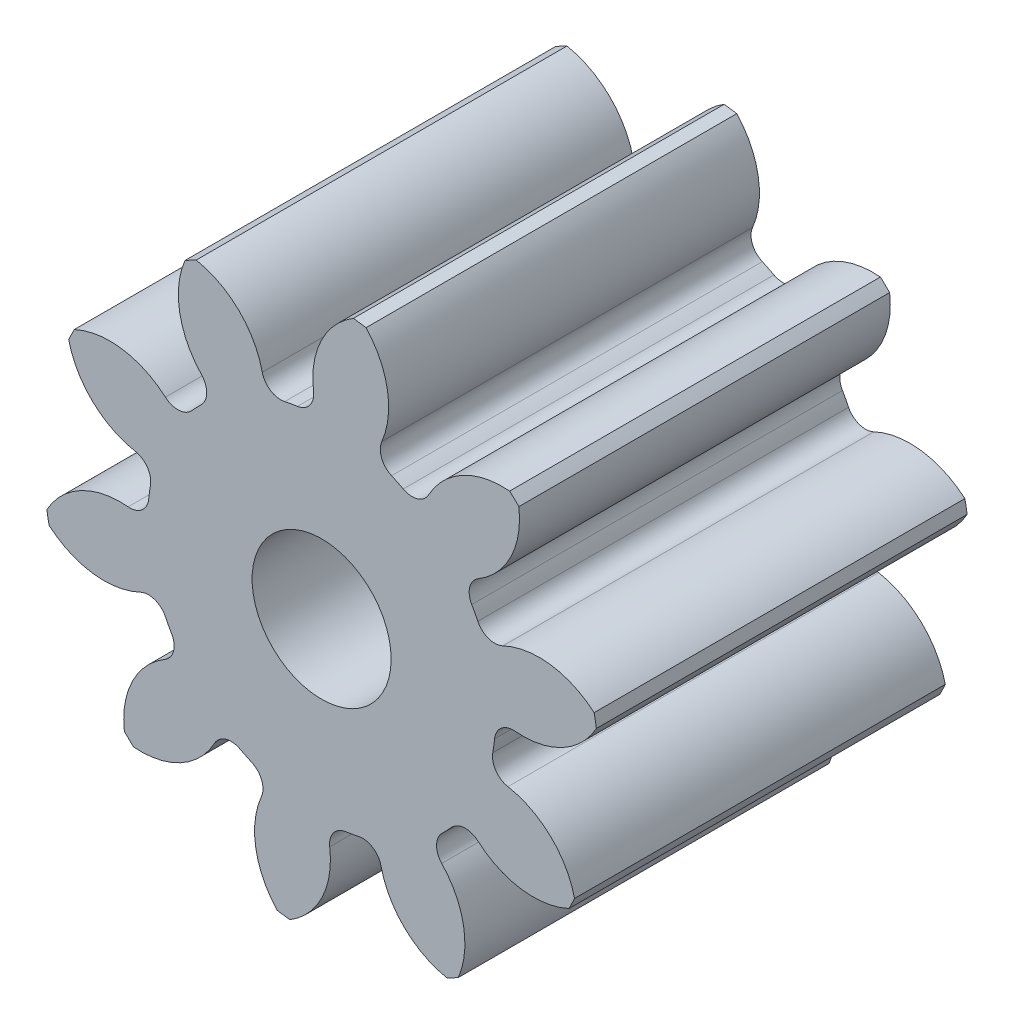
ISO-10303-21;
HEADER;
FILE_DESCRIPTION(('STEP AP214'),'2;1');
FILE_NAME('part.step','',(''),(''),'','','');
FILE_SCHEMA(('AUTOMOTIVE_DESIGN { 1 0 10303 214 1 1 1 1 }'));
ENDSEC;
DATA;
#1=APPLICATION_CONTEXT('core data for automotive mechanical design processes');
#2=APPLICATION_PROTOCOL_DEFINITION('international standard','automotive_design',2000,#1);
#3=PRODUCT_CONTEXT('',#1,'mechanical');
#4=PRODUCT('Part','Part','',(#3));
#5=PRODUCT_RELATED_PRODUCT_CATEGORY('part','',(#4));
#6=PRODUCT_DEFINITION_FORMATION('','',#4);
#7=PRODUCT_DEFINITION_CONTEXT('part definition',#1,'design');
#8=PRODUCT_DEFINITION('design','',#6,#7);
#9=PRODUCT_DEFINITION_SHAPE('','',#8);
#10=(LENGTH_UNIT() NAMED_UNIT(*) SI_UNIT(.MILLI.,.METRE.));
#11=(NAMED_UNIT(*) PLANE_ANGLE_UNIT() SI_UNIT($,.RADIAN.));
#12=(NAMED_UNIT(*) SI_UNIT($,.STERADIAN.) SOLID_ANGLE_UNIT());
#13=UNCERTAINTY_MEASURE_WITH_UNIT(LENGTH_MEASURE(1.E-05),#10,'distance_accuracy_value','');
#14=(GEOMETRIC_REPRESENTATION_CONTEXT(3) GLOBAL_UNCERTAINTY_ASSIGNED_CONTEXT((#13)) GLOBAL_UNIT_ASSIGNED_CONTEXT((#10,
#11,#12)) REPRESENTATION_CONTEXT('',''));
#15=CARTESIAN_POINT('',(0.,0.,0.));
#16=DIRECTION('',(0.,0.,1.));
#17=DIRECTION('',(1.,0.,0.));
#18=AXIS2_PLACEMENT_3D('',#15,#16,#17);
#19=CARTESIAN_POINT('',(0.,0.,101.6));
#20=DIRECTION('',(0.,0.,-1.));
#21=DIRECTION('',(-1.,0.,0.));
#22=AXIS2_PLACEMENT_3D('',#19,#20,#21);
#23=CYLINDRICAL_SURFACE('',#22,76.2);
#24=DIRECTION('',(0.,0.,-1.));
#25=VECTOR('',#24,1.);
#26=CARTESIAN_POINT('',(74.6834618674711,15.1268147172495,50.8));
#27=LINE('',#26,#25);
#28=CARTESIAN_POINT('',(74.6834618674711,15.1268147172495,101.6));
#29=VERTEX_POINT('',#28);
#30=CARTESIAN_POINT('',(74.6834618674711,15.1268147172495,0.));
#31=VERTEX_POINT('',#30);
#32=EDGE_CURVE('E456',#29,#31,#27,.T.);
#33=ORIENTED_EDGE('',*,*,#32,.F.);
#34=CARTESIAN_POINT('',(0.,0.,101.6));
#35=DIRECTION('',(0.,0.,1.));
#36=DIRECTION('',(1.,0.,0.));
#37=AXIS2_PLACEMENT_3D('',#34,#35,#36);
#38=CIRCLE('',#37,76.2);
#39=CARTESIAN_POINT('',(75.3003717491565,11.6745027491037,101.6));
#40=VERTEX_POINT('',#39);
#41=EDGE_CURVE('E797',#40,#29,#38,.T.);
#42=ORIENTED_EDGE('',*,*,#41,.F.);
#43=DIRECTION('',(0.,0.,-1.));
#44=VECTOR('',#43,1.);
#45=CARTESIAN_POINT('',(75.3003717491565,11.6745027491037,50.8));
#46=LINE('',#45,#44);
#47=CARTESIAN_POINT('',(75.3003717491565,11.6745027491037,0.));
#48=VERTEX_POINT('',#47);
#49=EDGE_CURVE('E791',#48,#40,#46,.F.);
#50=ORIENTED_EDGE('',*,*,#49,.F.);
#51=CARTESIAN_POINT('',(0.,0.,0.));
#52=DIRECTION('',(0.,0.,1.));
#53=DIRECTION('',(1.,0.,0.));
#54=AXIS2_PLACEMENT_3D('',#51,#52,#53);
#55=CIRCLE('',#54,76.2);
#56=EDGE_CURVE('E802',#48,#31,#55,.T.);
#57=ORIENTED_EDGE('',*,*,#56,.T.);
#58=EDGE_LOOP('',(#33,#42,#50,#57));
#59=FACE_BOUND('',#58,.T.);
#60=ADVANCED_FACE('F33',(#59),#23,.T.);
#61=DIRECTION('',(0.,0.,-1.));
#62=VECTOR('',#61,1.);
#63=CARTESIAN_POINT('',(54.0571798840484,53.7053191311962,50.8));
#64=LINE('',#63,#62);
#65=CARTESIAN_POINT('',(54.0571798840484,53.7053191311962,0.));
#66=VERTEX_POINT('',#65);
#67=CARTESIAN_POINT('',(54.0571798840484,53.7053191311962,101.6));
#68=VERTEX_POINT('',#67);
#69=EDGE_CURVE('E427',#66,#68,#64,.F.);
#70=ORIENTED_EDGE('',*,*,#69,.F.);
#71=CARTESIAN_POINT('',(51.5288712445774,56.1356876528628,0.));
#72=VERTEX_POINT('',#71);
#73=EDGE_CURVE('E805',#66,#72,#55,.T.);
#74=ORIENTED_EDGE('',*,*,#73,.T.);
#75=DIRECTION('',(0.,0.,-1.));
#76=VECTOR('',#75,1.);
#77=CARTESIAN_POINT('',(51.5288712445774,56.1356876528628,50.8));
#78=LINE('',#77,#76);
#79=CARTESIAN_POINT('',(51.5288712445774,56.1356876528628,101.6));
#80=VERTEX_POINT('',#79);
#81=EDGE_CURVE('E489',#80,#72,#78,.T.);
#82=ORIENTED_EDGE('',*,*,#81,.F.);
#83=EDGE_CURVE('E800',#68,#80,#38,.T.);
#84=ORIENTED_EDGE('',*,*,#83,.F.);
#85=EDGE_LOOP('',(#70,#74,#82,#84));
#86=FACE_BOUND('',#85,.T.);
#87=ADVANCED_FACE('F921',(#86),#23,.T.);
#88=CARTESIAN_POINT('',(0.,0.,101.6));
#89=DIRECTION('',(0.,0.,1.));
#90=DIRECTION('',(1.,0.,0.));
#91=AXIS2_PLACEMENT_3D('',#88,#89,#90);
#92=PLANE('',#91);
#93=CARTESIAN_POINT('',(0.,0.,101.599999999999));
#94=DIRECTION('',(0.,0.,1.));
#95=DIRECTION('',(1.,0.,0.));
#96=AXIS2_PLACEMENT_3D('',#93,#94,#95);
#97=CIRCLE('',#96,19.05);
#98=CARTESIAN_POINT('',(19.05,0.,101.599999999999));
#99=VERTEX_POINT('',#98);
#100=EDGE_CURVE('E444',#99,#99,#97,.T.);
#101=ORIENTED_EDGE('',*,*,#100,.F.);
#102=EDGE_LOOP('',(#101));
#103=FACE_BOUND('',#102,.T.);
#104=ORIENTED_EDGE('',*,*,#41,.T.);
#105=CARTESIAN_POINT('',(59.6250089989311,-2.32908882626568,101.6));
#106=DIRECTION('',(0.,0.,-1.));
#107=DIRECTION('',(0.809016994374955,0.587785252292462,0.));
#108=AXIS2_PLACEMENT_3D('',#105,#106,#107);
#109=CIRCLE('',#108,23.0535370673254);
#110=CARTESIAN_POINT('',(49.6840005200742,18.4709573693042,101.6));
#111=VERTEX_POINT('',#110);
#112=EDGE_CURVE('E436',#111,#29,#109,.T.);
#113=ORIENTED_EDGE('',*,*,#112,.F.);
#114=CARTESIAN_POINT('',(47.4550983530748,23.1345956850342,101.6));
#115=DIRECTION('',(0.,0.,1.));
#116=DIRECTION('',(-0.809016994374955,-0.587785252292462,0.));
#117=AXIS2_PLACEMENT_3D('',#114,#115,#116);
#118=CIRCLE('',#117,5.1689);
#119=CARTESIAN_POINT('',(42.8089051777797,20.8695534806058,101.6));
#120=VERTEX_POINT('',#119);
#121=EDGE_CURVE('E434',#120,#111,#118,.T.);
#122=ORIENTED_EDGE('',*,*,#121,.F.);
#123=CARTESIAN_POINT('',(0.,0.,101.6));
#124=DIRECTION('',(0.,0.,-1.));
#125=DIRECTION('',(0.809016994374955,0.587785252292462,0.));
#126=AXIS2_PLACEMENT_3D('',#123,#124,#125);
#127=CIRCLE('',#126,47.625);
#128=CARTESIAN_POINT('',(41.1302925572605,24.0091578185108,101.6));
#129=VERTEX_POINT('',#128);
#130=EDGE_CURVE('E419',#129,#120,#127,.T.);
#131=ORIENTED_EDGE('',*,*,#130,.F.);
#132=CARTESIAN_POINT('',(45.5943003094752,26.6149517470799,101.6));
#133=DIRECTION('',(0.,0.,1.));
#134=DIRECTION('',(-0.809016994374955,-0.587785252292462,0.));
#135=AXIS2_PLACEMENT_3D('',#132,#133,#134);
#136=CIRCLE('',#135,5.1689);
#137=CARTESIAN_POINT('',(42.9539275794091,31.0585942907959,101.6));
#138=VERTEX_POINT('',#137);
#139=EDGE_CURVE('E411',#138,#129,#136,.T.);
#140=ORIENTED_EDGE('',*,*,#139,.F.);
#141=CARTESIAN_POINT('',(31.1777410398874,50.8774489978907,101.6));
#142=DIRECTION('',(0.,0.,-1.));
#143=DIRECTION('',(-0.809016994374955,-0.587785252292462,0.));
#144=AXIS2_PLACEMENT_3D('',#141,#142,#143);
#145=CIRCLE('',#144,23.0535370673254);
#146=EDGE_CURVE('E441',#68,#138,#145,.T.);
#147=ORIENTED_EDGE('',*,*,#146,.F.);
#148=ORIENTED_EDGE('',*,*,#83,.T.);
#149=CARTESIAN_POINT('',(49.6066496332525,33.1624285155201,101.6));
#150=DIRECTION('',(0.,0.,-1.));
#151=DIRECTION('',(0.309016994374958,0.95105651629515,0.));
#152=AXIS2_PLACEMENT_3D('',#149,#150,#151);
#153=CIRCLE('',#152,23.0535370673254);
#154=CARTESIAN_POINT('',(29.3382444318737,44.1468411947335,101.6));
#155=VERTEX_POINT('',#154);
#156=EDGE_CURVE('E465',#155,#80,#153,.T.);
#157=ORIENTED_EDGE('',*,*,#156,.F.);
#158=CARTESIAN_POINT('',(24.7938068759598,46.6096880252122,101.6));
#159=DIRECTION('',(0.,0.,1.));
#160=DIRECTION('',(-0.309016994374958,-0.95105651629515,0.));
#161=AXIS2_PLACEMENT_3D('',#158,#159,#160);
#162=CIRCLE('',#161,5.1689);
#163=CARTESIAN_POINT('',(22.3663160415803,42.0462665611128,101.6));
#164=VERTEX_POINT('',#163);
#165=EDGE_CURVE('E463',#164,#155,#162,.T.);
#166=ORIENTED_EDGE('',*,*,#165,.F.);
#167=CARTESIAN_POINT('',(0.,0.,101.6));
#168=DIRECTION('',(0.,0.,-1.));
#169=DIRECTION('',(0.309016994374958,0.95105651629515,0.));
#170=AXIS2_PLACEMENT_3D('',#167,#168,#169);
#171=CIRCLE('',#170,47.625);
#172=CARTESIAN_POINT('',(19.1628767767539,43.599596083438,101.6));
#173=VERTEX_POINT('',#172);
#174=EDGE_CURVE('E460',#173,#164,#171,.T.);
#175=ORIENTED_EDGE('',*,*,#174,.F.);
#176=CARTESIAN_POINT('',(21.2426876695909,48.3316055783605,101.6));
#177=DIRECTION('',(0.,0.,1.));
#178=DIRECTION('',(-0.309016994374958,-0.95105651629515,0.));
#179=AXIS2_PLACEMENT_3D('',#176,#177,#178);
#180=CIRCLE('',#179,5.1689);
#181=CARTESIAN_POINT('',(16.4946737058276,50.3746157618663,101.6));
#182=VERTEX_POINT('',#181);
#183=EDGE_CURVE('E458',#182,#173,#180,.T.);
#184=ORIENTED_EDGE('',*,*,#183,.F.);
#185=CARTESIAN_POINT('',(-4.68169184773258,59.4865372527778,101.6));
#186=DIRECTION('',(0.,0.,-1.));
#187=DIRECTION('',(-0.309016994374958,-0.95105651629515,0.));
#188=AXIS2_PLACEMENT_3D('',#185,#186,#187);
#189=CIRCLE('',#188,23.0535370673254);
#190=CARTESIAN_POINT('',(12.1659826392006,75.2225289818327,101.6));
#191=VERTEX_POINT('',#190);
#192=EDGE_CURVE('E468',#191,#182,#189,.T.);
#193=ORIENTED_EDGE('',*,*,#192,.F.);
#194=CARTESIAN_POINT('',(8.69200320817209,75.7026358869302,101.6));
#195=VERTEX_POINT('',#194);
#196=EDGE_CURVE('E833',#191,#195,#38,.T.);
#197=ORIENTED_EDGE('',*,*,#196,.T.);
#198=CARTESIAN_POINT('',(20.6402361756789,55.9870253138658,101.6));
#199=DIRECTION('',(0.,0.,-1.));
#200=DIRECTION('',(-0.309016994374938,0.951056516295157,0.));
#201=AXIS2_PLACEMENT_3D('',#198,#199,#200);
#202=CIRCLE('',#201,23.0535370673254);
#203=CARTESIAN_POINT('',(-2.21372385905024,52.9601321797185,101.6));
#204=VERTEX_POINT('',#203);
#205=EDGE_CURVE('E500',#204,#195,#202,.T.);
#206=ORIENTED_EDGE('',*,*,#205,.F.);
#207=CARTESIAN_POINT('',(-7.33787611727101,52.281463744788,101.6));
#208=DIRECTION('',(0.,0.,1.));
#209=DIRECTION('',(0.309016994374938,-0.951056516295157,0.));
#210=AXIS2_PLACEMENT_3D('',#207,#208,#209);
#211=CIRCLE('',#210,5.1689);
#212=CARTESIAN_POINT('',(-6.61944561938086,47.1627349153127,101.6));
#213=VERTEX_POINT('',#212);
#214=EDGE_CURVE('E498',#213,#204,#211,.T.);
#215=ORIENTED_EDGE('',*,*,#214,.F.);
#216=CARTESIAN_POINT('',(0.,0.,101.6));
#217=DIRECTION('',(0.,0.,-1.));
#218=DIRECTION('',(-0.309016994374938,0.951056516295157,0.));
#219=AXIS2_PLACEMENT_3D('',#216,#217,#218);
#220=CIRCLE('',#219,47.625);
#221=CARTESIAN_POINT('',(-10.1241066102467,46.5364705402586,101.6));
#222=VERTEX_POINT('',#221);
#223=EDGE_CURVE('E495',#222,#213,#220,.T.);
#224=ORIENTED_EDGE('',*,*,#223,.F.);
#225=CARTESIAN_POINT('',(-11.2229096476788,51.5872288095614,101.6));
#226=DIRECTION('',(0.,0.,1.));
#227=DIRECTION('',(0.309016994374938,-0.951056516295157,0.));
#228=AXIS2_PLACEMENT_3D('',#225,#226,#227);
#229=CIRCLE('',#228,5.1689);
#230=CARTESIAN_POINT('',(-16.2649848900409,50.4492461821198,101.6));
#231=VERTEX_POINT('',#230);
#232=EDGE_CURVE('E493',#231,#222,#229,.T.);
#233=ORIENTED_EDGE('',*,*,#232,.F.);
#234=CARTESIAN_POINT('',(-38.752877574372,45.3737901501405,101.6));
#235=DIRECTION('',(0.,0.,-1.));
#236=DIRECTION('',(0.309016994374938,-0.951056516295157,0.));
#237=AXIS2_PLACEMENT_3D('',#234,#235,#236);
#238=CIRCLE('',#237,23.0535370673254);
#239=CARTESIAN_POINT('',(-34.3722064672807,68.007289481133,101.6));
#240=VERTEX_POINT('',#239);
#241=EDGE_CURVE('E503',#240,#231,#238,.T.);
#242=ORIENTED_EDGE('',*,*,#241,.F.);
#243=CARTESIAN_POINT('',(-37.4649146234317,66.3537502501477,101.6));
#244=VERTEX_POINT('',#243);
#245=EDGE_CURVE('E903',#240,#244,#38,.T.);
#246=ORIENTED_EDGE('',*,*,#245,.T.);
#247=CARTESIAN_POINT('',(-16.2100459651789,57.4264813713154,101.6));
#248=DIRECTION('',(0.,0.,-1.));
#249=DIRECTION('',(-0.809016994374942,0.58778525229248,0.));
#250=AXIS2_PLACEMENT_3D('',#247,#248,#249);
#251=CIRCLE('',#250,23.0535370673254);
#252=CARTESIAN_POINT('',(-32.9201248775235,41.5444527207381,101.6));
#253=VERTEX_POINT('',#252);
#254=EDGE_CURVE('E538',#253,#244,#251,.T.);
#255=ORIENTED_EDGE('',*,*,#254,.F.);
#256=CARTESIAN_POINT('',(-36.6667398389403,37.9834972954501,101.6));
#257=DIRECTION('',(0.,0.,1.));
#258=DIRECTION('',(0.809016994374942,-0.58778525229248,0.));
#259=AXIS2_PLACEMENT_3D('',#256,#257,#258);
#260=CIRCLE('',#259,5.1689);
#261=CARTESIAN_POINT('',(-33.0768040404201,34.2646415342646,101.6));
#262=VERTEX_POINT('',#261);
#263=EDGE_CURVE('E536',#262,#253,#260,.T.);
#264=ORIENTED_EDGE('',*,*,#263,.F.);
#265=CARTESIAN_POINT('',(0.,0.,101.6));
#266=DIRECTION('',(0.,0.,-1.));
#267=DIRECTION('',(-0.809016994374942,0.58778525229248,0.));
#268=AXIS2_PLACEMENT_3D('',#265,#266,#267);
#269=CIRCLE('',#268,47.625);
#270=CARTESIAN_POINT('',(-35.5440253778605,31.6979949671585,101.6));
#271=VERTEX_POINT('',#270);
#272=EDGE_CURVE('E533',#271,#262,#269,.T.);
#273=ORIENTED_EDGE('',*,*,#272,.F.);
#274=CARTESIAN_POINT('',(-39.4017369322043,35.1382840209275,101.6));
#275=DIRECTION('',(0.,0.,1.));
#276=DIRECTION('',(0.809016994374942,-0.58778525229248,0.));
#277=AXIS2_PLACEMENT_3D('',#274,#275,#276);
#278=CIRCLE('',#277,5.1689);
#279=CARTESIAN_POINT('',(-42.8119720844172,31.2539792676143,101.6));
#280=VERTEX_POINT('',#279);
#281=EDGE_CURVE('E531',#280,#271,#278,.T.);
#282=ORIENTED_EDGE('',*,*,#281,.F.);
#283=CARTESIAN_POINT('',(-58.0217812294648,13.9297974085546,101.6));
#284=DIRECTION('',(0.,0.,-1.));
#285=DIRECTION('',(0.809016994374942,-0.58778525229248,0.));
#286=AXIS2_PLACEMENT_3D('',#283,#284,#285);
#287=CIRCLE('',#286,23.0535370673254);
#288=CARTESIAN_POINT('',(-67.7813809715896,34.8155768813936,101.6));
#289=VERTEX_POINT('',#288);
#290=EDGE_CURVE('E541',#289,#280,#287,.T.);
#291=ORIENTED_EDGE('',*,*,#290,.F.);
#292=CARTESIAN_POINT('',(-69.3115084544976,31.6599872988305,101.6));
#293=VERTEX_POINT('',#292);
#294=EDGE_CURVE('E899',#289,#293,#38,.T.);
#295=ORIENTED_EDGE('',*,*,#294,.T.);
#296=CARTESIAN_POINT('',(-46.8686415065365,36.9309733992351,101.6));
#297=DIRECTION('',(0.,0.,-1.));
#298=DIRECTION('',(-1.,0.,0.));
#299=AXIS2_PLACEMENT_3D('',#296,#297,#298);
#300=CIRCLE('',#299,23.0535370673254);
#301=CARTESIAN_POINT('',(-51.0521571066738,14.2602043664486,101.6));
#302=VERTEX_POINT('',#301);
#303=EDGE_CURVE('E576',#302,#293,#300,.T.);
#304=ORIENTED_EDGE('',*,*,#303,.F.);
#305=CARTESIAN_POINT('',(-51.9901551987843,9.17712589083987,101.6));
#306=DIRECTION('',(0.,0.,1.));
#307=DIRECTION('',(1.,0.,0.));
#308=AXIS2_PLACEMENT_3D('',#305,#306,#307);
#309=CIRCLE('',#308,5.1689);
#310=CARTESIAN_POINT('',(-46.8999475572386,8.27861969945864,101.6));
#311=VERTEX_POINT('',#310);
#312=EDGE_CURVE('E574',#311,#302,#309,.T.);
#313=ORIENTED_EDGE('',*,*,#312,.F.);
#314=CARTESIAN_POINT('',(0.,0.,101.6));
#315=DIRECTION('',(0.,0.,-1.));
#316=DIRECTION('',(-1.,0.,0.));
#317=AXIS2_PLACEMENT_3D('',#314,#315,#316);
#318=CIRCLE('',#317,47.625);
#319=CARTESIAN_POINT('',(-47.3873345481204,4.7519626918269,101.6));
#320=VERTEX_POINT('',#319);
#321=EDGE_CURVE('E571',#320,#311,#318,.T.);
#322=ORIENTED_EDGE('',*,*,#321,.F.);
#323=CARTESIAN_POINT('',(-52.5304399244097,5.26770904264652,101.6));
#324=DIRECTION('',(0.,0.,1.));
#325=DIRECTION('',(1.,0.,0.));
#326=AXIS2_PLACEMENT_3D('',#323,#324,#325);
#327=CIRCLE('',#326,5.1689);
#328=CARTESIAN_POINT('',(-53.0062410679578,0.120754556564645,101.6));
#329=VERTEX_POINT('',#328);
#330=EDGE_CURVE('E569',#329,#320,#327,.T.);
#331=ORIENTED_EDGE('',*,*,#330,.F.);
#332=CARTESIAN_POINT('',(-55.1283365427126,-22.834904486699,101.6));
#333=DIRECTION('',(0.,0.,-1.));
#334=DIRECTION('',(1.,0.,0.));
#335=AXIS2_PLACEMENT_3D('',#332,#333,#334);
#336=CIRCLE('',#335,23.0535370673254);
#337=CARTESIAN_POINT('',(-75.3003717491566,-11.6745027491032,101.6));
#338=VERTEX_POINT('',#337);
#339=EDGE_CURVE('E579',#338,#329,#336,.T.);
#340=ORIENTED_EDGE('',*,*,#339,.F.);
#341=CARTESIAN_POINT('',(-74.683461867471,-15.12681471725,101.6));
#342=VERTEX_POINT('',#341);
#343=EDGE_CURVE('E895',#338,#342,#38,.T.);
#344=ORIENTED_EDGE('',*,*,#343,.T.);
#345=CARTESIAN_POINT('',(-59.6250089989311,2.32908882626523,101.6));
#346=DIRECTION('',(0.,0.,-1.));
#347=DIRECTION('',(-0.809016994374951,-0.587785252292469,0.));
#348=AXIS2_PLACEMENT_3D('',#345,#346,#347);
#349=CIRCLE('',#348,23.0535370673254);
#350=CARTESIAN_POINT('',(-49.6840005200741,-18.4709573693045,101.6));
#351=VERTEX_POINT('',#350);
#352=EDGE_CURVE('E614',#351,#342,#349,.T.);
#353=ORIENTED_EDGE('',*,*,#352,.F.);
#354=CARTESIAN_POINT('',(-47.4550983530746,-23.1345956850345,101.6));
#355=DIRECTION('',(0.,0.,1.));
#356=DIRECTION('',(0.809016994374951,0.587785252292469,0.));
#357=AXIS2_PLACEMENT_3D('',#354,#355,#356);
#358=CIRCLE('',#357,5.1689);
#359=CARTESIAN_POINT('',(-42.8089051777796,-20.8695534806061,101.6));
#360=VERTEX_POINT('',#359);
#361=EDGE_CURVE('E612',#360,#351,#358,.T.);
#362=ORIENTED_EDGE('',*,*,#361,.F.);
#363=CARTESIAN_POINT('',(0.,0.,101.6));
#364=DIRECTION('',(0.,0.,-1.));
#365=DIRECTION('',(-0.809016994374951,-0.587785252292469,0.));
#366=AXIS2_PLACEMENT_3D('',#363,#364,#365);
#367=CIRCLE('',#366,47.625);
#368=CARTESIAN_POINT('',(-41.1302925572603,-24.0091578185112,101.6));
#369=VERTEX_POINT('',#368);
#370=EDGE_CURVE('E609',#369,#360,#367,.T.);
#371=ORIENTED_EDGE('',*,*,#370,.F.);
#372=CARTESIAN_POINT('',(-45.594300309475,-26.6149517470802,101.6));
#373=DIRECTION('',(0.,0.,1.));
#374=DIRECTION('',(0.809016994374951,0.587785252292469,0.));
#375=AXIS2_PLACEMENT_3D('',#372,#373,#374);
#376=CIRCLE('',#375,5.1689);
#377=CARTESIAN_POINT('',(-42.9539275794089,-31.0585942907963,101.6));
#378=VERTEX_POINT('',#377);
#379=EDGE_CURVE('E607',#378,#369,#376,.T.);
#380=ORIENTED_EDGE('',*,*,#379,.F.);
#381=CARTESIAN_POINT('',(-31.177741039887,-50.877448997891,101.6));
#382=DIRECTION('',(0.,0.,-1.));
#383=DIRECTION('',(0.809016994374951,0.587785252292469,0.));
#384=AXIS2_PLACEMENT_3D('',#381,#382,#383);
#385=CIRCLE('',#384,23.0535370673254);
#386=CARTESIAN_POINT('',(-54.057179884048,-53.7053191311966,101.6));
#387=VERTEX_POINT('',#386);
#388=EDGE_CURVE('E617',#387,#378,#385,.T.);
#389=ORIENTED_EDGE('',*,*,#388,.F.);
#390=CARTESIAN_POINT('',(-51.5288712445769,-56.1356876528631,101.6));
#391=VERTEX_POINT('',#390);
#392=EDGE_CURVE('E891',#387,#391,#38,.T.);
#393=ORIENTED_EDGE('',*,*,#392,.T.);
#394=CARTESIAN_POINT('',(-49.6066496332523,-33.1624285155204,101.6));
#395=DIRECTION('',(0.,0.,-1.));
#396=DIRECTION('',(-0.309016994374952,-0.951056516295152,0.));
#397=AXIS2_PLACEMENT_3D('',#394,#395,#396);
#398=CIRCLE('',#397,23.0535370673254);
#399=CARTESIAN_POINT('',(-29.3382444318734,-44.1468411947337,101.6));
#400=VERTEX_POINT('',#399);
#401=EDGE_CURVE('E652',#400,#391,#398,.T.);
#402=ORIENTED_EDGE('',*,*,#401,.F.);
#403=CARTESIAN_POINT('',(-24.7938068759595,-46.6096880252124,101.6));
#404=DIRECTION('',(0.,0.,1.));
#405=DIRECTION('',(0.309016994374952,0.951056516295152,0.));
#406=AXIS2_PLACEMENT_3D('',#403,#404,#405);
#407=CIRCLE('',#406,5.1689);
#408=CARTESIAN_POINT('',(-22.36631604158,-42.0462665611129,101.6));
#409=VERTEX_POINT('',#408);
#410=EDGE_CURVE('E650',#409,#400,#407,.T.);
#411=ORIENTED_EDGE('',*,*,#410,.F.);
#412=CARTESIAN_POINT('',(0.,0.,101.6));
#413=DIRECTION('',(0.,0.,-1.));
#414=DIRECTION('',(-0.309016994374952,-0.951056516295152,0.));
#415=AXIS2_PLACEMENT_3D('',#412,#413,#414);
#416=CIRCLE('',#415,47.625);
#417=CARTESIAN_POINT('',(-19.1628767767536,-43.5995960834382,101.6));
#418=VERTEX_POINT('',#417);
#419=EDGE_CURVE('E647',#418,#409,#416,.T.);
#420=ORIENTED_EDGE('',*,*,#419,.F.);
#421=CARTESIAN_POINT('',(-21.2426876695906,-48.3316055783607,101.6));
#422=DIRECTION('',(0.,0.,1.));
#423=DIRECTION('',(0.309016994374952,0.951056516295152,0.));
#424=AXIS2_PLACEMENT_3D('',#421,#422,#423);
#425=CIRCLE('',#424,5.1689);
#426=CARTESIAN_POINT('',(-16.4946737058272,-50.3746157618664,101.6));
#427=VERTEX_POINT('',#426);
#428=EDGE_CURVE('E645',#427,#418,#425,.T.);
#429=ORIENTED_EDGE('',*,*,#428,.F.);
#430=CARTESIAN_POINT('',(4.68169184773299,-59.4865372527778,101.6));
#431=DIRECTION('',(0.,0.,-1.));
#432=DIRECTION('',(0.309016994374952,0.951056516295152,0.));
#433=AXIS2_PLACEMENT_3D('',#430,#431,#432);
#434=CIRCLE('',#433,23.0535370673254);
#435=CARTESIAN_POINT('',(-12.1659826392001,-75.2225289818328,101.6));
#436=VERTEX_POINT('',#435);
#437=EDGE_CURVE('E655',#436,#427,#434,.T.);
#438=ORIENTED_EDGE('',*,*,#437,.F.);
#439=CARTESIAN_POINT('',(-8.69200320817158,-75.7026358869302,101.6));
#440=VERTEX_POINT('',#439);
#441=EDGE_CURVE('E887',#436,#440,#38,.T.);
#442=ORIENTED_EDGE('',*,*,#441,.T.);
#443=CARTESIAN_POINT('',(-20.6402361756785,-55.9870253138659,101.6));
#444=DIRECTION('',(0.,0.,-1.));
#445=DIRECTION('',(0.309016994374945,-0.951056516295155,0.));
#446=AXIS2_PLACEMENT_3D('',#443,#444,#445);
#447=CIRCLE('',#446,23.0535370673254);
#448=CARTESIAN_POINT('',(2.2137238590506,-52.9601321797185,101.6));
#449=VERTEX_POINT('',#448);
#450=EDGE_CURVE('E690',#449,#440,#447,.T.);
#451=ORIENTED_EDGE('',*,*,#450,.F.);
#452=CARTESIAN_POINT('',(7.33787611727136,-52.281463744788,101.6));
#453=DIRECTION('',(0.,0.,1.));
#454=DIRECTION('',(-0.309016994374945,0.951056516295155,0.));
#455=AXIS2_PLACEMENT_3D('',#452,#453,#454);
#456=CIRCLE('',#455,5.1689);
#457=CARTESIAN_POINT('',(6.61944561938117,-47.1627349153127,101.6));
#458=VERTEX_POINT('',#457);
#459=EDGE_CURVE('E688',#458,#449,#456,.T.);
#460=ORIENTED_EDGE('',*,*,#459,.F.);
#461=CARTESIAN_POINT('',(0.,0.,101.6));
#462=DIRECTION('',(0.,0.,-1.));
#463=DIRECTION('',(0.309016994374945,-0.951056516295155,0.));
#464=AXIS2_PLACEMENT_3D('',#461,#462,#463);
#465=CIRCLE('',#464,47.625);
#466=CARTESIAN_POINT('',(10.124106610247,-46.5364705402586,101.6));
#467=VERTEX_POINT('',#466);
#468=EDGE_CURVE('E685',#467,#458,#465,.T.);
#469=ORIENTED_EDGE('',*,*,#468,.F.);
#470=CARTESIAN_POINT('',(11.2229096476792,-51.5872288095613,101.6));
#471=DIRECTION('',(0.,0.,1.));
#472=DIRECTION('',(-0.309016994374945,0.951056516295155,0.));
#473=AXIS2_PLACEMENT_3D('',#470,#471,#472);
#474=CIRCLE('',#473,5.1689);
#475=CARTESIAN_POINT('',(16.2649848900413,-50.4492461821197,101.6));
#476=VERTEX_POINT('',#475);
#477=EDGE_CURVE('E683',#476,#467,#474,.T.);
#478=ORIENTED_EDGE('',*,*,#477,.F.);
#479=CARTESIAN_POINT('',(38.7528775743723,-45.3737901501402,101.6));
#480=DIRECTION('',(0.,0.,-1.));
#481=DIRECTION('',(-0.309016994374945,0.951056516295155,0.));
#482=AXIS2_PLACEMENT_3D('',#479,#480,#481);
#483=CIRCLE('',#482,23.0535370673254);
#484=CARTESIAN_POINT('',(34.3722064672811,-68.0072894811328,101.6));
#485=VERTEX_POINT('',#484);
#486=EDGE_CURVE('E693',#485,#476,#483,.T.);
#487=ORIENTED_EDGE('',*,*,#486,.F.);
#488=CARTESIAN_POINT('',(37.4649146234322,-66.3537502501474,101.6));
#489=VERTEX_POINT('',#488);
#490=EDGE_CURVE('E886',#485,#489,#38,.T.);
#491=ORIENTED_EDGE('',*,*,#490,.T.);
#492=CARTESIAN_POINT('',(16.2100459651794,-57.4264813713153,101.6));
#493=DIRECTION('',(0.,0.,-1.));
#494=DIRECTION('',(0.809016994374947,-0.587785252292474,0.));
#495=AXIS2_PLACEMENT_3D('',#492,#493,#494);
#496=CIRCLE('',#495,23.0535370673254);
#497=CARTESIAN_POINT('',(32.9201248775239,-41.5444527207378,101.6));
#498=VERTEX_POINT('',#497);
#499=EDGE_CURVE('E728',#498,#489,#496,.T.);
#500=ORIENTED_EDGE('',*,*,#499,.F.);
#501=CARTESIAN_POINT('',(36.6667398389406,-37.9834972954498,101.6));
#502=DIRECTION('',(0.,0.,1.));
#503=DIRECTION('',(-0.809016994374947,0.587785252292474,0.));
#504=AXIS2_PLACEMENT_3D('',#501,#502,#503);
#505=CIRCLE('',#504,5.1689);
#506=CARTESIAN_POINT('',(33.0768040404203,-34.2646415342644,101.6));
#507=VERTEX_POINT('',#506);
#508=EDGE_CURVE('E726',#507,#498,#505,.T.);
#509=ORIENTED_EDGE('',*,*,#508,.F.);
#510=CARTESIAN_POINT('',(0.,0.,101.6));
#511=DIRECTION('',(0.,0.,-1.));
#512=DIRECTION('',(0.809016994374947,-0.587785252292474,0.));
#513=AXIS2_PLACEMENT_3D('',#510,#511,#512);
#514=CIRCLE('',#513,47.625);
#515=CARTESIAN_POINT('',(35.5440253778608,-31.6979949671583,101.6));
#516=VERTEX_POINT('',#515);
#517=EDGE_CURVE('E723',#516,#507,#514,.T.);
#518=ORIENTED_EDGE('',*,*,#517,.F.);
#519=CARTESIAN_POINT('',(39.4017369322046,-35.1382840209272,101.6));
#520=DIRECTION('',(0.,0.,1.));
#521=DIRECTION('',(-0.809016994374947,0.587785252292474,0.));
#522=AXIS2_PLACEMENT_3D('',#519,#520,#521);
#523=CIRCLE('',#522,5.1689);
#524=CARTESIAN_POINT('',(42.8119720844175,-31.253979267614,101.6));
#525=VERTEX_POINT('',#524);
#526=EDGE_CURVE('E721',#525,#516,#523,.T.);
#527=ORIENTED_EDGE('',*,*,#526,.F.);
#528=CARTESIAN_POINT('',(58.0217812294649,-13.9297974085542,101.6));
#529=DIRECTION('',(0.,0.,-1.));
#530=DIRECTION('',(-0.809016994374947,0.587785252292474,0.));
#531=AXIS2_PLACEMENT_3D('',#528,#529,#530);
#532=CIRCLE('',#531,23.0535370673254);
#533=CARTESIAN_POINT('',(67.7813809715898,-34.8155768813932,101.6));
#534=VERTEX_POINT('',#533);
#535=EDGE_CURVE('E731',#534,#525,#532,.T.);
#536=ORIENTED_EDGE('',*,*,#535,.F.);
#537=CARTESIAN_POINT('',(69.3115084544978,-31.65998729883,101.6));
#538=VERTEX_POINT('',#537);
#539=EDGE_CURVE('E801',#534,#538,#38,.T.);
#540=ORIENTED_EDGE('',*,*,#539,.T.);
#541=CARTESIAN_POINT('',(46.8686415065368,-36.9309733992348,101.6));
#542=DIRECTION('',(0.,0.,-1.));
#543=DIRECTION('',(1.,0.,0.));
#544=AXIS2_PLACEMENT_3D('',#541,#542,#543);
#545=CIRCLE('',#544,23.0535370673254);
#546=CARTESIAN_POINT('',(51.0521571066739,-14.2602043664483,101.6));
#547=VERTEX_POINT('',#546);
#548=EDGE_CURVE('E766',#547,#538,#545,.T.);
#549=ORIENTED_EDGE('',*,*,#548,.F.);
#550=CARTESIAN_POINT('',(51.9901551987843,-9.1771258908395,101.6));
#551=DIRECTION('',(0.,0.,1.));
#552=DIRECTION('',(-1.,0.,0.));
#553=AXIS2_PLACEMENT_3D('',#550,#551,#552);
#554=CIRCLE('',#553,5.1689);
#555=CARTESIAN_POINT('',(46.8999475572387,-8.27861969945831,101.6));
#556=VERTEX_POINT('',#555);
#557=EDGE_CURVE('E764',#556,#547,#554,.T.);
#558=ORIENTED_EDGE('',*,*,#557,.F.);
#559=CARTESIAN_POINT('',(0.,0.,101.6));
#560=DIRECTION('',(0.,0.,-1.));
#561=DIRECTION('',(1.,0.,0.));
#562=AXIS2_PLACEMENT_3D('',#559,#560,#561);
#563=CIRCLE('',#562,47.625);
#564=CARTESIAN_POINT('',(47.3873345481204,-4.75196269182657,101.6));
#565=VERTEX_POINT('',#564);
#566=EDGE_CURVE('E761',#565,#556,#563,.T.);
#567=ORIENTED_EDGE('',*,*,#566,.F.);
#568=CARTESIAN_POINT('',(52.5304399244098,-5.26770904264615,101.6));
#569=DIRECTION('',(0.,0.,1.));
#570=DIRECTION('',(-1.,0.,0.));
#571=AXIS2_PLACEMENT_3D('',#568,#569,#570);
#572=CIRCLE('',#571,5.1689);
#573=CARTESIAN_POINT('',(53.0062410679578,-0.120754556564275,101.6));
#574=VERTEX_POINT('',#573);
#575=EDGE_CURVE('E759',#574,#565,#572,.T.);
#576=ORIENTED_EDGE('',*,*,#575,.F.);
#577=CARTESIAN_POINT('',(55.1283365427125,22.8349044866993,101.6));
#578=DIRECTION('',(0.,0.,-1.));
#579=DIRECTION('',(-1.,0.,0.));
#580=AXIS2_PLACEMENT_3D('',#577,#578,#579);
#581=CIRCLE('',#580,23.0535370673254);
#582=EDGE_CURVE('E769',#40,#574,#581,.T.);
#583=ORIENTED_EDGE('',*,*,#582,.F.);
#584=EDGE_LOOP('',(#104,#113,#122,#131,#140,#147,#148,#157,#166,#175,#184,#193,#197,#206,#215,
#224,#233,#242,#246,#255,#264,#273,#282,#291,#295,#304,#313,#322,#331,#340,#344,#353,#362,#371,
#380,#389,#393,#402,#411,#420,#429,#438,#442,#451,#460,#469,#478,#487,#491,#500,#509,#518,#527,
#536,#540,#549,#558,#567,#576,#583));
#585=FACE_BOUND('',#584,.T.);
#586=ADVANCED_FACE('F432',(#103,#585),#92,.T.);
#587=CARTESIAN_POINT('',(0.,0.,0.));
#588=DIRECTION('',(0.,0.,1.));
#589=DIRECTION('',(1.,0.,0.));
#590=AXIS2_PLACEMENT_3D('',#587,#588,#589);
#591=PLANE('',#590);
#592=CARTESIAN_POINT('',(0.,0.,0.));
#593=DIRECTION('',(0.,0.,1.));
#594=DIRECTION('',(1.,0.,0.));
#595=AXIS2_PLACEMENT_3D('',#592,#593,#594);
#596=CIRCLE('',#595,19.05);
#597=CARTESIAN_POINT('',(19.05,0.,-1.77635683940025E-12));
#598=VERTEX_POINT('',#597);
#599=EDGE_CURVE('E36',#598,#598,#596,.T.);
#600=ORIENTED_EDGE('',*,*,#599,.T.);
#601=EDGE_LOOP('',(#600));
#602=FACE_BOUND('',#601,.T.);
#603=CARTESIAN_POINT('',(59.6250089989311,-2.32908882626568,0.));
#604=DIRECTION('',(0.,0.,-1.));
#605=DIRECTION('',(0.809016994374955,0.587785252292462,0.));
#606=AXIS2_PLACEMENT_3D('',#603,#604,#605);
#607=CIRCLE('',#606,23.0535370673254);
#608=CARTESIAN_POINT('',(49.6840005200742,18.4709573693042,0.));
#609=VERTEX_POINT('',#608);
#610=EDGE_CURVE('E420',#609,#31,#607,.T.);
#611=ORIENTED_EDGE('',*,*,#610,.T.);
#612=ORIENTED_EDGE('',*,*,#56,.F.);
#613=CARTESIAN_POINT('',(55.1283365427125,22.8349044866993,0.));
#614=DIRECTION('',(0.,0.,1.));
#615=DIRECTION('',(1.,0.,0.));
#616=AXIS2_PLACEMENT_3D('',#613,#614,#615);
#617=CIRCLE('',#616,23.0535370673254);
#618=CARTESIAN_POINT('',(53.0062410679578,-0.120754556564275,0.));
#619=VERTEX_POINT('',#618);
#620=EDGE_CURVE('E799',#619,#48,#617,.T.);
#621=ORIENTED_EDGE('',*,*,#620,.F.);
#622=CARTESIAN_POINT('',(52.5304399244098,-5.26770904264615,0.));
#623=DIRECTION('',(0.,0.,1.));
#624=DIRECTION('',(-1.,0.,0.));
#625=AXIS2_PLACEMENT_3D('',#622,#623,#624);
#626=CIRCLE('',#625,5.1689);
#627=CARTESIAN_POINT('',(47.3873345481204,-4.75196269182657,0.));
#628=VERTEX_POINT('',#627);
#629=EDGE_CURVE('E758',#619,#628,#626,.T.);
#630=ORIENTED_EDGE('',*,*,#629,.T.);
#631=CARTESIAN_POINT('',(0.,0.,0.));
#632=DIRECTION('',(0.,0.,-1.));
#633=DIRECTION('',(1.,0.,0.));
#634=AXIS2_PLACEMENT_3D('',#631,#632,#633);
#635=CIRCLE('',#634,47.625);
#636=CARTESIAN_POINT('',(46.8999475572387,-8.27861969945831,0.));
#637=VERTEX_POINT('',#636);
#638=EDGE_CURVE('E774',#628,#637,#635,.T.);
#639=ORIENTED_EDGE('',*,*,#638,.T.);
#640=CARTESIAN_POINT('',(51.9901551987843,-9.1771258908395,0.));
#641=DIRECTION('',(0.,0.,1.));
#642=DIRECTION('',(-1.,0.,0.));
#643=AXIS2_PLACEMENT_3D('',#640,#641,#642);
#644=CIRCLE('',#643,5.1689);
#645=CARTESIAN_POINT('',(51.0521571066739,-14.2602043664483,0.));
#646=VERTEX_POINT('',#645);
#647=EDGE_CURVE('E777',#637,#646,#644,.T.);
#648=ORIENTED_EDGE('',*,*,#647,.T.);
#649=CARTESIAN_POINT('',(46.8686415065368,-36.9309733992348,0.));
#650=DIRECTION('',(0.,0.,-1.));
#651=DIRECTION('',(1.,0.,0.));
#652=AXIS2_PLACEMENT_3D('',#649,#650,#651);
#653=CIRCLE('',#652,23.0535370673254);
#654=CARTESIAN_POINT('',(69.3115084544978,-31.65998729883,0.));
#655=VERTEX_POINT('',#654);
#656=EDGE_CURVE('E762',#646,#655,#653,.T.);
#657=ORIENTED_EDGE('',*,*,#656,.T.);
#658=CARTESIAN_POINT('',(67.7813809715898,-34.8155768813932,0.));
#659=VERTEX_POINT('',#658);
#660=EDGE_CURVE('E796',#659,#655,#55,.T.);
#661=ORIENTED_EDGE('',*,*,#660,.F.);
#662=CARTESIAN_POINT('',(58.0217812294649,-13.9297974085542,0.));
#663=DIRECTION('',(0.,0.,1.));
#664=DIRECTION('',(1.,0.,0.));
#665=AXIS2_PLACEMENT_3D('',#662,#663,#664);
#666=CIRCLE('',#665,23.0535370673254);
#667=CARTESIAN_POINT('',(42.8119720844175,-31.253979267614,0.));
#668=VERTEX_POINT('',#667);
#669=EDGE_CURVE('E807',#668,#659,#666,.T.);
#670=ORIENTED_EDGE('',*,*,#669,.F.);
#671=CARTESIAN_POINT('',(39.4017369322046,-35.1382840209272,0.));
#672=DIRECTION('',(0.,0.,1.));
#673=DIRECTION('',(-0.809016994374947,0.587785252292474,0.));
#674=AXIS2_PLACEMENT_3D('',#671,#672,#673);
#675=CIRCLE('',#674,5.1689);
#676=CARTESIAN_POINT('',(35.5440253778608,-31.6979949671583,0.));
#677=VERTEX_POINT('',#676);
#678=EDGE_CURVE('E720',#668,#677,#675,.T.);
#679=ORIENTED_EDGE('',*,*,#678,.T.);
#680=CARTESIAN_POINT('',(0.,0.,0.));
#681=DIRECTION('',(0.,0.,-1.));
#682=DIRECTION('',(0.809016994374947,-0.587785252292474,0.));
#683=AXIS2_PLACEMENT_3D('',#680,#681,#682);
#684=CIRCLE('',#683,47.625);
#685=CARTESIAN_POINT('',(33.0768040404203,-34.2646415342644,0.));
#686=VERTEX_POINT('',#685);
#687=EDGE_CURVE('E736',#677,#686,#684,.T.);
#688=ORIENTED_EDGE('',*,*,#687,.T.);
#689=CARTESIAN_POINT('',(36.6667398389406,-37.9834972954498,0.));
#690=DIRECTION('',(0.,0.,1.));
#691=DIRECTION('',(-0.809016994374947,0.587785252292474,0.));
#692=AXIS2_PLACEMENT_3D('',#689,#690,#691);
#693=CIRCLE('',#692,5.1689);
#694=CARTESIAN_POINT('',(32.9201248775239,-41.5444527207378,0.));
#695=VERTEX_POINT('',#694);
#696=EDGE_CURVE('E739',#686,#695,#693,.T.);
#697=ORIENTED_EDGE('',*,*,#696,.T.);
#698=CARTESIAN_POINT('',(16.2100459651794,-57.4264813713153,0.));
#699=DIRECTION('',(0.,0.,-1.));
#700=DIRECTION('',(0.809016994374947,-0.587785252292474,0.));
#701=AXIS2_PLACEMENT_3D('',#698,#699,#700);
#702=CIRCLE('',#701,23.0535370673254);
#703=CARTESIAN_POINT('',(37.4649146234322,-66.3537502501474,0.));
#704=VERTEX_POINT('',#703);
#705=EDGE_CURVE('E724',#695,#704,#702,.T.);
#706=ORIENTED_EDGE('',*,*,#705,.T.);
#707=CARTESIAN_POINT('',(34.3722064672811,-68.0072894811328,0.));
#708=VERTEX_POINT('',#707);
#709=EDGE_CURVE('E857',#708,#704,#55,.T.);
#710=ORIENTED_EDGE('',*,*,#709,.F.);
#711=CARTESIAN_POINT('',(38.7528775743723,-45.3737901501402,0.));
#712=DIRECTION('',(0.,0.,1.));
#713=DIRECTION('',(1.,0.,0.));
#714=AXIS2_PLACEMENT_3D('',#711,#712,#713);
#715=CIRCLE('',#714,23.0535370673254);
#716=CARTESIAN_POINT('',(16.2649848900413,-50.4492461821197,0.));
#717=VERTEX_POINT('',#716);
#718=EDGE_CURVE('E809',#717,#708,#715,.T.);
#719=ORIENTED_EDGE('',*,*,#718,.F.);
#720=CARTESIAN_POINT('',(11.2229096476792,-51.5872288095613,0.));
#721=DIRECTION('',(0.,0.,1.));
#722=DIRECTION('',(-0.309016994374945,0.951056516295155,0.));
#723=AXIS2_PLACEMENT_3D('',#720,#721,#722);
#724=CIRCLE('',#723,5.1689);
#725=CARTESIAN_POINT('',(10.124106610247,-46.5364705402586,0.));
#726=VERTEX_POINT('',#725);
#727=EDGE_CURVE('E682',#717,#726,#724,.T.);
#728=ORIENTED_EDGE('',*,*,#727,.T.);
#729=CARTESIAN_POINT('',(0.,0.,0.));
#730=DIRECTION('',(0.,0.,-1.));
#731=DIRECTION('',(0.309016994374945,-0.951056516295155,0.));
#732=AXIS2_PLACEMENT_3D('',#729,#730,#731);
#733=CIRCLE('',#732,47.625);
#734=CARTESIAN_POINT('',(6.61944561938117,-47.1627349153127,0.));
#735=VERTEX_POINT('',#734);
#736=EDGE_CURVE('E698',#726,#735,#733,.T.);
#737=ORIENTED_EDGE('',*,*,#736,.T.);
#738=CARTESIAN_POINT('',(7.33787611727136,-52.281463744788,0.));
#739=DIRECTION('',(0.,0.,1.));
#740=DIRECTION('',(-0.309016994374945,0.951056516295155,0.));
#741=AXIS2_PLACEMENT_3D('',#738,#739,#740);
#742=CIRCLE('',#741,5.1689);
#743=CARTESIAN_POINT('',(2.2137238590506,-52.9601321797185,0.));
#744=VERTEX_POINT('',#743);
#745=EDGE_CURVE('E701',#735,#744,#742,.T.);
#746=ORIENTED_EDGE('',*,*,#745,.T.);
#747=CARTESIAN_POINT('',(-20.6402361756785,-55.9870253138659,0.));
#748=DIRECTION('',(0.,0.,-1.));
#749=DIRECTION('',(0.309016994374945,-0.951056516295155,0.));
#750=AXIS2_PLACEMENT_3D('',#747,#748,#749);
#751=CIRCLE('',#750,23.0535370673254);
#752=CARTESIAN_POINT('',(-8.69200320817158,-75.7026358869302,0.));
#753=VERTEX_POINT('',#752);
#754=EDGE_CURVE('E686',#744,#753,#751,.T.);
#755=ORIENTED_EDGE('',*,*,#754,.T.);
#756=CARTESIAN_POINT('',(-12.1659826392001,-75.2225289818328,0.));
#757=VERTEX_POINT('',#756);
#758=EDGE_CURVE('E852',#757,#753,#55,.T.);
#759=ORIENTED_EDGE('',*,*,#758,.F.);
#760=CARTESIAN_POINT('',(4.68169184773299,-59.4865372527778,0.));
#761=DIRECTION('',(0.,0.,1.));
#762=DIRECTION('',(1.,0.,0.));
#763=AXIS2_PLACEMENT_3D('',#760,#761,#762);
#764=CIRCLE('',#763,23.0535370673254);
#765=CARTESIAN_POINT('',(-16.4946737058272,-50.3746157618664,0.));
#766=VERTEX_POINT('',#765);
#767=EDGE_CURVE('E811',#766,#757,#764,.T.);
#768=ORIENTED_EDGE('',*,*,#767,.F.);
#769=CARTESIAN_POINT('',(-21.2426876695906,-48.3316055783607,0.));
#770=DIRECTION('',(0.,0.,1.));
#771=DIRECTION('',(0.309016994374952,0.951056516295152,0.));
#772=AXIS2_PLACEMENT_3D('',#769,#770,#771);
#773=CIRCLE('',#772,5.1689);
#774=CARTESIAN_POINT('',(-19.1628767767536,-43.5995960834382,0.));
#775=VERTEX_POINT('',#774);
#776=EDGE_CURVE('E644',#766,#775,#773,.T.);
#777=ORIENTED_EDGE('',*,*,#776,.T.);
#778=CARTESIAN_POINT('',(0.,0.,0.));
#779=DIRECTION('',(0.,0.,-1.));
#780=DIRECTION('',(-0.309016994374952,-0.951056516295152,0.));
#781=AXIS2_PLACEMENT_3D('',#778,#779,#780);
#782=CIRCLE('',#781,47.625);
#783=CARTESIAN_POINT('',(-22.36631604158,-42.0462665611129,0.));
#784=VERTEX_POINT('',#783);
#785=EDGE_CURVE('E660',#775,#784,#782,.T.);
#786=ORIENTED_EDGE('',*,*,#785,.T.);
#787=CARTESIAN_POINT('',(-24.7938068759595,-46.6096880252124,0.));
#788=DIRECTION('',(0.,0.,1.));
#789=DIRECTION('',(0.309016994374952,0.951056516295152,0.));
#790=AXIS2_PLACEMENT_3D('',#787,#788,#789);
#791=CIRCLE('',#790,5.1689);
#792=CARTESIAN_POINT('',(-29.3382444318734,-44.1468411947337,0.));
#793=VERTEX_POINT('',#792);
#794=EDGE_CURVE('E663',#784,#793,#791,.T.);
#795=ORIENTED_EDGE('',*,*,#794,.T.);
#796=CARTESIAN_POINT('',(-49.6066496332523,-33.1624285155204,0.));
#797=DIRECTION('',(0.,0.,-1.));
#798=DIRECTION('',(-0.309016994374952,-0.951056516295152,0.));
#799=AXIS2_PLACEMENT_3D('',#796,#797,#798);
#800=CIRCLE('',#799,23.0535370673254);
#801=CARTESIAN_POINT('',(-51.5288712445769,-56.1356876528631,0.));
#802=VERTEX_POINT('',#801);
#803=EDGE_CURVE('E648',#793,#802,#800,.T.);
#804=ORIENTED_EDGE('',*,*,#803,.T.);
#805=CARTESIAN_POINT('',(-54.057179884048,-53.7053191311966,0.));
#806=VERTEX_POINT('',#805);
#807=EDGE_CURVE('E847',#806,#802,#55,.T.);
#808=ORIENTED_EDGE('',*,*,#807,.F.);
#809=CARTESIAN_POINT('',(-31.177741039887,-50.877448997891,0.));
#810=DIRECTION('',(0.,0.,1.));
#811=DIRECTION('',(1.,0.,0.));
#812=AXIS2_PLACEMENT_3D('',#809,#810,#811);
#813=CIRCLE('',#812,23.0535370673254);
#814=CARTESIAN_POINT('',(-42.9539275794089,-31.0585942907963,0.));
#815=VERTEX_POINT('',#814);
#816=EDGE_CURVE('E813',#815,#806,#813,.T.);
#817=ORIENTED_EDGE('',*,*,#816,.F.);
#818=CARTESIAN_POINT('',(-45.594300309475,-26.6149517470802,0.));
#819=DIRECTION('',(0.,0.,1.));
#820=DIRECTION('',(0.809016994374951,0.587785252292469,0.));
#821=AXIS2_PLACEMENT_3D('',#818,#819,#820);
#822=CIRCLE('',#821,5.1689);
#823=CARTESIAN_POINT('',(-41.1302925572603,-24.0091578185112,0.));
#824=VERTEX_POINT('',#823);
#825=EDGE_CURVE('E606',#815,#824,#822,.T.);
#826=ORIENTED_EDGE('',*,*,#825,.T.);
#827=CARTESIAN_POINT('',(0.,0.,0.));
#828=DIRECTION('',(0.,0.,-1.));
#829=DIRECTION('',(-0.809016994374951,-0.587785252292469,0.));
#830=AXIS2_PLACEMENT_3D('',#827,#828,#829);
#831=CIRCLE('',#830,47.625);
#832=CARTESIAN_POINT('',(-42.8089051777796,-20.8695534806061,0.));
#833=VERTEX_POINT('',#832);
#834=EDGE_CURVE('E622',#824,#833,#831,.T.);
#835=ORIENTED_EDGE('',*,*,#834,.T.);
#836=CARTESIAN_POINT('',(-47.4550983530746,-23.1345956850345,0.));
#837=DIRECTION('',(0.,0.,1.));
#838=DIRECTION('',(0.809016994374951,0.587785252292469,0.));
#839=AXIS2_PLACEMENT_3D('',#836,#837,#838);
#840=CIRCLE('',#839,5.1689);
#841=CARTESIAN_POINT('',(-49.6840005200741,-18.4709573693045,0.));
#842=VERTEX_POINT('',#841);
#843=EDGE_CURVE('E625',#833,#842,#840,.T.);
#844=ORIENTED_EDGE('',*,*,#843,.T.);
#845=CARTESIAN_POINT('',(-59.6250089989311,2.32908882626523,0.));
#846=DIRECTION('',(0.,0.,-1.));
#847=DIRECTION('',(-0.809016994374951,-0.587785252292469,0.));
#848=AXIS2_PLACEMENT_3D('',#845,#846,#847);
#849=CIRCLE('',#848,23.0535370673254);
#850=CARTESIAN_POINT('',(-74.683461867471,-15.12681471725,0.));
#851=VERTEX_POINT('',#850);
#852=EDGE_CURVE('E610',#842,#851,#849,.T.);
#853=ORIENTED_EDGE('',*,*,#852,.T.);
#854=CARTESIAN_POINT('',(-75.3003717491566,-11.6745027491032,0.));
#855=VERTEX_POINT('',#854);
#856=EDGE_CURVE('E842',#855,#851,#55,.T.);
#857=ORIENTED_EDGE('',*,*,#856,.F.);
#858=CARTESIAN_POINT('',(-55.1283365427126,-22.834904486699,0.));
#859=DIRECTION('',(0.,0.,1.));
#860=DIRECTION('',(1.,0.,0.));
#861=AXIS2_PLACEMENT_3D('',#858,#859,#860);
#862=CIRCLE('',#861,23.0535370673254);
#863=CARTESIAN_POINT('',(-53.0062410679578,0.120754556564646,0.));
#864=VERTEX_POINT('',#863);
#865=EDGE_CURVE('E815',#864,#855,#862,.T.);
#866=ORIENTED_EDGE('',*,*,#865,.F.);
#867=CARTESIAN_POINT('',(-52.5304399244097,5.26770904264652,0.));
#868=DIRECTION('',(0.,0.,1.));
#869=DIRECTION('',(1.,0.,0.));
#870=AXIS2_PLACEMENT_3D('',#867,#868,#869);
#871=CIRCLE('',#870,5.1689);
#872=CARTESIAN_POINT('',(-47.3873345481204,4.7519626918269,0.));
#873=VERTEX_POINT('',#872);
#874=EDGE_CURVE('E568',#864,#873,#871,.T.);
#875=ORIENTED_EDGE('',*,*,#874,.T.);
#876=CARTESIAN_POINT('',(0.,0.,0.));
#877=DIRECTION('',(0.,0.,-1.));
#878=DIRECTION('',(-1.,0.,0.));
#879=AXIS2_PLACEMENT_3D('',#876,#877,#878);
#880=CIRCLE('',#879,47.625);
#881=CARTESIAN_POINT('',(-46.8999475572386,8.27861969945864,0.));
#882=VERTEX_POINT('',#881);
#883=EDGE_CURVE('E584',#873,#882,#880,.T.);
#884=ORIENTED_EDGE('',*,*,#883,.T.);
#885=CARTESIAN_POINT('',(-51.9901551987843,9.17712589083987,0.));
#886=DIRECTION('',(0.,0.,1.));
#887=DIRECTION('',(1.,0.,0.));
#888=AXIS2_PLACEMENT_3D('',#885,#886,#887);
#889=CIRCLE('',#888,5.1689);
#890=CARTESIAN_POINT('',(-51.0521571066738,14.2602043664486,0.));
#891=VERTEX_POINT('',#890);
#892=EDGE_CURVE('E587',#882,#891,#889,.T.);
#893=ORIENTED_EDGE('',*,*,#892,.T.);
#894=CARTESIAN_POINT('',(-46.8686415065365,36.9309733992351,0.));
#895=DIRECTION('',(0.,0.,-1.));
#896=DIRECTION('',(-1.,0.,0.));
#897=AXIS2_PLACEMENT_3D('',#894,#895,#896);
#898=CIRCLE('',#897,23.0535370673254);
#899=CARTESIAN_POINT('',(-69.3115084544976,31.6599872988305,0.));
#900=VERTEX_POINT('',#899);
#901=EDGE_CURVE('E572',#891,#900,#898,.T.);
#902=ORIENTED_EDGE('',*,*,#901,.T.);
#903=CARTESIAN_POINT('',(-67.7813809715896,34.8155768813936,0.));
#904=VERTEX_POINT('',#903);
#905=EDGE_CURVE('E837',#904,#900,#55,.T.);
#906=ORIENTED_EDGE('',*,*,#905,.F.);
#907=CARTESIAN_POINT('',(-58.0217812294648,13.9297974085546,0.));
#908=DIRECTION('',(0.,0.,1.));
#909=DIRECTION('',(1.,0.,0.));
#910=AXIS2_PLACEMENT_3D('',#907,#908,#909);
#911=CIRCLE('',#910,23.0535370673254);
#912=CARTESIAN_POINT('',(-42.8119720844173,31.2539792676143,0.));
#913=VERTEX_POINT('',#912);
#914=EDGE_CURVE('E817',#913,#904,#911,.T.);
#915=ORIENTED_EDGE('',*,*,#914,.F.);
#916=CARTESIAN_POINT('',(-39.4017369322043,35.1382840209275,0.));
#917=DIRECTION('',(0.,0.,1.));
#918=DIRECTION('',(0.809016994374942,-0.58778525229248,0.));
#919=AXIS2_PLACEMENT_3D('',#916,#917,#918);
#920=CIRCLE('',#919,5.1689);
#921=CARTESIAN_POINT('',(-35.5440253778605,31.6979949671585,0.));
#922=VERTEX_POINT('',#921);
#923=EDGE_CURVE('E530',#913,#922,#920,.T.);
#924=ORIENTED_EDGE('',*,*,#923,.T.);
#925=CARTESIAN_POINT('',(0.,0.,0.));
#926=DIRECTION('',(0.,0.,-1.));
#927=DIRECTION('',(-0.809016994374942,0.58778525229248,0.));
#928=AXIS2_PLACEMENT_3D('',#925,#926,#927);
#929=CIRCLE('',#928,47.625);
#930=CARTESIAN_POINT('',(-33.0768040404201,34.2646415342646,0.));
#931=VERTEX_POINT('',#930);
#932=EDGE_CURVE('E546',#922,#931,#929,.T.);
#933=ORIENTED_EDGE('',*,*,#932,.T.);
#934=CARTESIAN_POINT('',(-36.6667398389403,37.9834972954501,0.));
#935=DIRECTION('',(0.,0.,1.));
#936=DIRECTION('',(0.809016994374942,-0.58778525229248,0.));
#937=AXIS2_PLACEMENT_3D('',#934,#935,#936);
#938=CIRCLE('',#937,5.1689);
#939=CARTESIAN_POINT('',(-32.9201248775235,41.5444527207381,0.));
#940=VERTEX_POINT('',#939);
#941=EDGE_CURVE('E549',#931,#940,#938,.T.);
#942=ORIENTED_EDGE('',*,*,#941,.T.);
#943=CARTESIAN_POINT('',(-16.2100459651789,57.4264813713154,0.));
#944=DIRECTION('',(0.,0.,-1.));
#945=DIRECTION('',(-0.809016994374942,0.58778525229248,0.));
#946=AXIS2_PLACEMENT_3D('',#943,#944,#945);
#947=CIRCLE('',#946,23.0535370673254);
#948=CARTESIAN_POINT('',(-37.4649146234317,66.3537502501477,0.));
#949=VERTEX_POINT('',#948);
#950=EDGE_CURVE('E534',#940,#949,#947,.T.);
#951=ORIENTED_EDGE('',*,*,#950,.T.);
#952=CARTESIAN_POINT('',(-34.3722064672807,68.007289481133,0.));
#953=VERTEX_POINT('',#952);
#954=EDGE_CURVE('E836',#953,#949,#55,.T.);
#955=ORIENTED_EDGE('',*,*,#954,.F.);
#956=CARTESIAN_POINT('',(-38.752877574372,45.3737901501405,0.));
#957=DIRECTION('',(0.,0.,1.));
#958=DIRECTION('',(1.,0.,0.));
#959=AXIS2_PLACEMENT_3D('',#956,#957,#958);
#960=CIRCLE('',#959,23.0535370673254);
#961=CARTESIAN_POINT('',(-16.264984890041,50.4492461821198,0.));
#962=VERTEX_POINT('',#961);
#963=EDGE_CURVE('E819',#962,#953,#960,.T.);
#964=ORIENTED_EDGE('',*,*,#963,.F.);
#965=CARTESIAN_POINT('',(-11.2229096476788,51.5872288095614,0.));
#966=DIRECTION('',(0.,0.,1.));
#967=DIRECTION('',(0.309016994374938,-0.951056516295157,0.));
#968=AXIS2_PLACEMENT_3D('',#965,#966,#967);
#969=CIRCLE('',#968,5.1689);
#970=CARTESIAN_POINT('',(-10.1241066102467,46.5364705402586,0.));
#971=VERTEX_POINT('',#970);
#972=EDGE_CURVE('E492',#962,#971,#969,.T.);
#973=ORIENTED_EDGE('',*,*,#972,.T.);
#974=CARTESIAN_POINT('',(0.,0.,0.));
#975=DIRECTION('',(0.,0.,-1.));
#976=DIRECTION('',(-0.309016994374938,0.951056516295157,0.));
#977=AXIS2_PLACEMENT_3D('',#974,#975,#976);
#978=CIRCLE('',#977,47.625);
#979=CARTESIAN_POINT('',(-6.61944561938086,47.1627349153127,0.));
#980=VERTEX_POINT('',#979);
#981=EDGE_CURVE('E508',#971,#980,#978,.T.);
#982=ORIENTED_EDGE('',*,*,#981,.T.);
#983=CARTESIAN_POINT('',(-7.33787611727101,52.281463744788,0.));
#984=DIRECTION('',(0.,0.,1.));
#985=DIRECTION('',(0.309016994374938,-0.951056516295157,0.));
#986=AXIS2_PLACEMENT_3D('',#983,#984,#985);
#987=CIRCLE('',#986,5.1689);
#988=CARTESIAN_POINT('',(-2.21372385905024,52.9601321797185,0.));
#989=VERTEX_POINT('',#988);
#990=EDGE_CURVE('E511',#980,#989,#987,.T.);
#991=ORIENTED_EDGE('',*,*,#990,.T.);
#992=CARTESIAN_POINT('',(20.6402361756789,55.9870253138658,0.));
#993=DIRECTION('',(0.,0.,-1.));
#994=DIRECTION('',(-0.309016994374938,0.951056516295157,0.));
#995=AXIS2_PLACEMENT_3D('',#992,#993,#994);
#996=CIRCLE('',#995,23.0535370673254);
#997=CARTESIAN_POINT('',(8.69200320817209,75.7026358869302,0.));
#998=VERTEX_POINT('',#997);
#999=EDGE_CURVE('E496',#989,#998,#996,.T.);
#1000=ORIENTED_EDGE('',*,*,#999,.T.);
#1001=CARTESIAN_POINT('',(12.1659826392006,75.2225289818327,0.));
#1002=VERTEX_POINT('',#1001);
#1003=EDGE_CURVE('E832',#1002,#998,#55,.T.);
#1004=ORIENTED_EDGE('',*,*,#1003,.F.);
#1005=CARTESIAN_POINT('',(-4.68169184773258,59.4865372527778,0.));
#1006=DIRECTION('',(0.,0.,1.));
#1007=DIRECTION('',(1.,0.,0.));
#1008=AXIS2_PLACEMENT_3D('',#1005,#1006,#1007);
#1009=CIRCLE('',#1008,23.0535370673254);
#1010=CARTESIAN_POINT('',(16.4946737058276,50.3746157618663,0.));
#1011=VERTEX_POINT('',#1010);
#1012=EDGE_CURVE('E41',#1011,#1002,#1009,.T.);
#1013=ORIENTED_EDGE('',*,*,#1012,.F.);
#1014=CARTESIAN_POINT('',(21.2426876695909,48.3316055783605,0.));
#1015=DIRECTION('',(0.,0.,1.));
#1016=DIRECTION('',(-0.309016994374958,-0.95105651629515,0.));
#1017=AXIS2_PLACEMENT_3D('',#1014,#1015,#1016);
#1018=CIRCLE('',#1017,5.1689);
#1019=CARTESIAN_POINT('',(19.1628767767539,43.599596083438,0.));
#1020=VERTEX_POINT('',#1019);
#1021=EDGE_CURVE('E56',#1011,#1020,#1018,.T.);
#1022=ORIENTED_EDGE('',*,*,#1021,.T.);
#1023=CARTESIAN_POINT('',(0.,0.,0.));
#1024=DIRECTION('',(0.,0.,-1.));
#1025=DIRECTION('',(0.309016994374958,0.95105651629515,0.));
#1026=AXIS2_PLACEMENT_3D('',#1023,#1024,#1025);
#1027=CIRCLE('',#1026,47.625);
#1028=CARTESIAN_POINT('',(22.3663160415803,42.0462665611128,0.));
#1029=VERTEX_POINT('',#1028);
#1030=EDGE_CURVE('E472',#1020,#1029,#1027,.T.);
#1031=ORIENTED_EDGE('',*,*,#1030,.T.);
#1032=CARTESIAN_POINT('',(24.7938068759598,46.6096880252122,0.));
#1033=DIRECTION('',(0.,0.,1.));
#1034=DIRECTION('',(-0.309016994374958,-0.95105651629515,0.));
#1035=AXIS2_PLACEMENT_3D('',#1032,#1033,#1034);
#1036=CIRCLE('',#1035,5.1689);
#1037=CARTESIAN_POINT('',(29.3382444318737,44.1468411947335,0.));
#1038=VERTEX_POINT('',#1037);
#1039=EDGE_CURVE('E475',#1029,#1038,#1036,.T.);
#1040=ORIENTED_EDGE('',*,*,#1039,.T.);
#1041=CARTESIAN_POINT('',(49.6066496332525,33.1624285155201,0.));
#1042=DIRECTION('',(0.,0.,-1.));
#1043=DIRECTION('',(0.309016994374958,0.95105651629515,0.));
#1044=AXIS2_PLACEMENT_3D('',#1041,#1042,#1043);
#1045=CIRCLE('',#1044,23.0535370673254);
#1046=EDGE_CURVE('E461',#1038,#72,#1045,.T.);
#1047=ORIENTED_EDGE('',*,*,#1046,.T.);
#1048=ORIENTED_EDGE('',*,*,#73,.F.);
#1049=CARTESIAN_POINT('',(31.1777410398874,50.8774489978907,0.));
#1050=DIRECTION('',(0.,0.,1.));
#1051=DIRECTION('',(1.,0.,0.));
#1052=AXIS2_PLACEMENT_3D('',#1049,#1050,#1051);
#1053=CIRCLE('',#1052,23.0535370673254);
#1054=CARTESIAN_POINT('',(42.9539275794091,31.0585942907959,0.));
#1055=VERTEX_POINT('',#1054);
#1056=EDGE_CURVE('E11',#1055,#66,#1053,.T.);
#1057=ORIENTED_EDGE('',*,*,#1056,.F.);
#1058=CARTESIAN_POINT('',(45.5943003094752,26.6149517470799,0.));
#1059=DIRECTION('',(0.,0.,1.));
#1060=DIRECTION('',(-0.809016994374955,-0.587785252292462,0.));
#1061=AXIS2_PLACEMENT_3D('',#1058,#1059,#1060);
#1062=CIRCLE('',#1061,5.1689);
#1063=CARTESIAN_POINT('',(41.1302925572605,24.0091578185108,0.));
#1064=VERTEX_POINT('',#1063);
#1065=EDGE_CURVE('E48',#1055,#1064,#1062,.T.);
#1066=ORIENTED_EDGE('',*,*,#1065,.T.);
#1067=CARTESIAN_POINT('',(0.,0.,0.));
#1068=DIRECTION('',(0.,0.,-1.));
#1069=DIRECTION('',(0.809016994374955,0.587785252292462,0.));
#1070=AXIS2_PLACEMENT_3D('',#1067,#1068,#1069);
#1071=CIRCLE('',#1070,47.625);
#1072=CARTESIAN_POINT('',(42.8089051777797,20.8695534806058,0.));
#1073=VERTEX_POINT('',#1072);
#1074=EDGE_CURVE('E426',#1064,#1073,#1071,.T.);
#1075=ORIENTED_EDGE('',*,*,#1074,.T.);
#1076=CARTESIAN_POINT('',(47.4550983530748,23.1345956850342,0.));
#1077=DIRECTION('',(0.,0.,1.));
#1078=DIRECTION('',(-0.809016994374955,-0.587785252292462,0.));
#1079=AXIS2_PLACEMENT_3D('',#1076,#1077,#1078);
#1080=CIRCLE('',#1079,5.1689);
#1081=EDGE_CURVE('E446',#1073,#609,#1080,.T.);
#1082=ORIENTED_EDGE('',*,*,#1081,.T.);
#1083=EDGE_LOOP('',(#611,#612,#621,#630,#639,#648,#657,#661,#670,#679,#688,#697,#706,#710,#719,
#728,#737,#746,#755,#759,#768,#777,#786,#795,#804,#808,#817,#826,#835,#844,#853,#857,#866,#875,
#884,#893,#902,#906,#915,#924,#933,#942,#951,#955,#964,#973,#982,#991,#1000,#1004,#1013,#1022,
#1031,#1040,#1047,#1048,#1057,#1066,#1075,#1082));
#1084=FACE_BOUND('',#1083,.T.);
#1085=ADVANCED_FACE('F834',(#602,#1084),#591,.F.);
#1086=DIRECTION('',(0.,0.,-1.));
#1087=VECTOR('',#1086,1.);
#1088=CARTESIAN_POINT('',(12.1659826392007,75.2225289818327,50.8));
#1089=LINE('',#1088,#1087);
#1090=EDGE_CURVE('E487',#1002,#191,#1089,.F.);
#1091=ORIENTED_EDGE('',*,*,#1090,.F.);
#1092=ORIENTED_EDGE('',*,*,#1003,.T.);
#1093=DIRECTION('',(0.,0.,-1.));
#1094=VECTOR('',#1093,1.);
#1095=CARTESIAN_POINT('',(8.69200320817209,75.7026358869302,50.8));
#1096=LINE('',#1095,#1094);
#1097=EDGE_CURVE('E527',#195,#998,#1096,.T.);
#1098=ORIENTED_EDGE('',*,*,#1097,.F.);
#1099=ORIENTED_EDGE('',*,*,#196,.F.);
#1100=EDGE_LOOP('',(#1091,#1092,#1098,#1099));
#1101=FACE_BOUND('',#1100,.T.);
#1102=ADVANCED_FACE('F830',(#1101),#23,.T.);
#1103=DIRECTION('',(0.,0.,-1.));
#1104=VECTOR('',#1103,1.);
#1105=CARTESIAN_POINT('',(-34.3722064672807,68.007289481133,50.8));
#1106=LINE('',#1105,#1104);
#1107=EDGE_CURVE('E525',#953,#240,#1106,.F.);
#1108=ORIENTED_EDGE('',*,*,#1107,.F.);
#1109=ORIENTED_EDGE('',*,*,#954,.T.);
#1110=DIRECTION('',(0.,0.,-1.));
#1111=VECTOR('',#1110,1.);
#1112=CARTESIAN_POINT('',(-37.4649146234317,66.3537502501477,50.8));
#1113=LINE('',#1112,#1111);
#1114=EDGE_CURVE('E565',#244,#949,#1113,.T.);
#1115=ORIENTED_EDGE('',*,*,#1114,.F.);
#1116=ORIENTED_EDGE('',*,*,#245,.F.);
#1117=EDGE_LOOP('',(#1108,#1109,#1115,#1116));
#1118=FACE_BOUND('',#1117,.T.);
#1119=ADVANCED_FACE('F1019',(#1118),#23,.T.);
#1120=DIRECTION('',(0.,0.,-1.));
#1121=VECTOR('',#1120,1.);
#1122=CARTESIAN_POINT('',(-67.7813809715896,34.8155768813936,50.8));
#1123=LINE('',#1122,#1121);
#1124=EDGE_CURVE('E563',#904,#289,#1123,.F.);
#1125=ORIENTED_EDGE('',*,*,#1124,.F.);
#1126=ORIENTED_EDGE('',*,*,#905,.T.);
#1127=DIRECTION('',(0.,0.,-1.));
#1128=VECTOR('',#1127,1.);
#1129=CARTESIAN_POINT('',(-69.3115084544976,31.6599872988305,50.8));
#1130=LINE('',#1129,#1128);
#1131=EDGE_CURVE('E603',#293,#900,#1130,.T.);
#1132=ORIENTED_EDGE('',*,*,#1131,.F.);
#1133=ORIENTED_EDGE('',*,*,#294,.F.);
#1134=EDGE_LOOP('',(#1125,#1126,#1132,#1133));
#1135=FACE_BOUND('',#1134,.T.);
#1136=ADVANCED_FACE('F1107',(#1135),#23,.T.);
#1137=DIRECTION('',(0.,0.,-1.));
#1138=VECTOR('',#1137,1.);
#1139=CARTESIAN_POINT('',(-75.3003717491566,-11.6745027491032,50.8));
#1140=LINE('',#1139,#1138);
#1141=EDGE_CURVE('E601',#855,#338,#1140,.F.);
#1142=ORIENTED_EDGE('',*,*,#1141,.F.);
#1143=ORIENTED_EDGE('',*,*,#856,.T.);
#1144=DIRECTION('',(0.,0.,-1.));
#1145=VECTOR('',#1144,1.);
#1146=CARTESIAN_POINT('',(-74.683461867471,-15.12681471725,50.8));
#1147=LINE('',#1146,#1145);
#1148=EDGE_CURVE('E641',#342,#851,#1147,.T.);
#1149=ORIENTED_EDGE('',*,*,#1148,.F.);
#1150=ORIENTED_EDGE('',*,*,#343,.F.);
#1151=EDGE_LOOP('',(#1142,#1143,#1149,#1150));
#1152=FACE_BOUND('',#1151,.T.);
#1153=ADVANCED_FACE('F1114',(#1152),#23,.T.);
#1154=DIRECTION('',(0.,0.,-1.));
#1155=VECTOR('',#1154,1.);
#1156=CARTESIAN_POINT('',(-54.057179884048,-53.7053191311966,50.8));
#1157=LINE('',#1156,#1155);
#1158=EDGE_CURVE('E639',#806,#387,#1157,.F.);
#1159=ORIENTED_EDGE('',*,*,#1158,.F.);
#1160=ORIENTED_EDGE('',*,*,#807,.T.);
#1161=DIRECTION('',(0.,0.,-1.));
#1162=VECTOR('',#1161,1.);
#1163=CARTESIAN_POINT('',(-51.5288712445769,-56.1356876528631,50.8));
#1164=LINE('',#1163,#1162);
#1165=EDGE_CURVE('E679',#391,#802,#1164,.T.);
#1166=ORIENTED_EDGE('',*,*,#1165,.F.);
#1167=ORIENTED_EDGE('',*,*,#392,.F.);
#1168=EDGE_LOOP('',(#1159,#1160,#1166,#1167));
#1169=FACE_BOUND('',#1168,.T.);
#1170=ADVANCED_FACE('F961',(#1169),#23,.T.);
#1171=DIRECTION('',(0.,0.,-1.));
#1172=VECTOR('',#1171,1.);
#1173=CARTESIAN_POINT('',(-12.1659826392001,-75.2225289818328,50.8));
#1174=LINE('',#1173,#1172);
#1175=EDGE_CURVE('E677',#757,#436,#1174,.F.);
#1176=ORIENTED_EDGE('',*,*,#1175,.F.);
#1177=ORIENTED_EDGE('',*,*,#758,.T.);
#1178=DIRECTION('',(0.,0.,-1.));
#1179=VECTOR('',#1178,1.);
#1180=CARTESIAN_POINT('',(-8.69200320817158,-75.7026358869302,50.8));
#1181=LINE('',#1180,#1179);
#1182=EDGE_CURVE('E717',#440,#753,#1181,.T.);
#1183=ORIENTED_EDGE('',*,*,#1182,.F.);
#1184=ORIENTED_EDGE('',*,*,#441,.F.);
#1185=EDGE_LOOP('',(#1176,#1177,#1183,#1184));
#1186=FACE_BOUND('',#1185,.T.);
#1187=ADVANCED_FACE('F957',(#1186),#23,.T.);
#1188=DIRECTION('',(0.,0.,-1.));
#1189=VECTOR('',#1188,1.);
#1190=CARTESIAN_POINT('',(34.3722064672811,-68.0072894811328,50.8));
#1191=LINE('',#1190,#1189);
#1192=EDGE_CURVE('E715',#708,#485,#1191,.F.);
#1193=ORIENTED_EDGE('',*,*,#1192,.F.);
#1194=ORIENTED_EDGE('',*,*,#709,.T.);
#1195=DIRECTION('',(0.,0.,-1.));
#1196=VECTOR('',#1195,1.);
#1197=CARTESIAN_POINT('',(37.4649146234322,-66.3537502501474,50.8));
#1198=LINE('',#1197,#1196);
#1199=EDGE_CURVE('E755',#489,#704,#1198,.T.);
#1200=ORIENTED_EDGE('',*,*,#1199,.F.);
#1201=ORIENTED_EDGE('',*,*,#490,.F.);
#1202=EDGE_LOOP('',(#1193,#1194,#1200,#1201));
#1203=FACE_BOUND('',#1202,.T.);
#1204=ADVANCED_FACE('F950',(#1203),#23,.T.);
#1205=DIRECTION('',(0.,0.,-1.));
#1206=VECTOR('',#1205,1.);
#1207=CARTESIAN_POINT('',(67.7813809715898,-34.8155768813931,50.8));
#1208=LINE('',#1207,#1206);
#1209=EDGE_CURVE('E753',#659,#534,#1208,.F.);
#1210=ORIENTED_EDGE('',*,*,#1209,.F.);
#1211=ORIENTED_EDGE('',*,*,#660,.T.);
#1212=DIRECTION('',(0.,0.,-1.));
#1213=VECTOR('',#1212,1.);
#1214=CARTESIAN_POINT('',(69.3115084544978,-31.65998729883,50.8));
#1215=LINE('',#1214,#1213);
#1216=EDGE_CURVE('E793',#538,#655,#1215,.T.);
#1217=ORIENTED_EDGE('',*,*,#1216,.F.);
#1218=ORIENTED_EDGE('',*,*,#539,.F.);
#1219=EDGE_LOOP('',(#1210,#1211,#1217,#1218));
#1220=FACE_BOUND('',#1219,.T.);
#1221=ADVANCED_FACE('F870',(#1220),#23,.T.);
#1222=CARTESIAN_POINT('',(46.8686415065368,-36.9309733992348,101.6));
#1223=DIRECTION('',(0.,0.,-1.));
#1224=DIRECTION('',(-1.,0.,0.));
#1225=AXIS2_PLACEMENT_3D('',#1222,#1223,#1224);
#1226=CYLINDRICAL_SURFACE('',#1225,23.0535370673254);
#1227=ORIENTED_EDGE('',*,*,#1216,.T.);
#1228=ORIENTED_EDGE('',*,*,#656,.F.);
#1229=DIRECTION('',(0.,0.,-1.));
#1230=VECTOR('',#1229,1.);
#1231=CARTESIAN_POINT('',(51.0521571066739,-14.2602043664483,101.6));
#1232=LINE('',#1231,#1230);
#1233=EDGE_CURVE('E784',#547,#646,#1232,.T.);
#1234=ORIENTED_EDGE('',*,*,#1233,.F.);
#1235=ORIENTED_EDGE('',*,*,#548,.T.);
#1236=EDGE_LOOP('',(#1227,#1228,#1234,#1235));
#1237=FACE_BOUND('',#1236,.T.);
#1238=ADVANCED_FACE('F875',(#1237),#1226,.T.);
#1239=CARTESIAN_POINT('',(55.1283365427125,22.8349044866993,101.6));
#1240=DIRECTION('',(0.,0.,-1.));
#1241=DIRECTION('',(-1.,0.,0.));
#1242=AXIS2_PLACEMENT_3D('',#1239,#1240,#1241);
#1243=CYLINDRICAL_SURFACE('',#1242,23.0535370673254);
#1244=ORIENTED_EDGE('',*,*,#49,.T.);
#1245=ORIENTED_EDGE('',*,*,#582,.T.);
#1246=DIRECTION('',(0.,0.,-1.));
#1247=VECTOR('',#1246,1.);
#1248=CARTESIAN_POINT('',(53.0062410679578,-0.120754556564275,101.6));
#1249=LINE('',#1248,#1247);
#1250=EDGE_CURVE('E771',#574,#619,#1249,.T.);
#1251=ORIENTED_EDGE('',*,*,#1250,.T.);
#1252=ORIENTED_EDGE('',*,*,#620,.T.);
#1253=EDGE_LOOP('',(#1244,#1245,#1251,#1252));
#1254=FACE_BOUND('',#1253,.T.);
#1255=ADVANCED_FACE('F955',(#1254),#1243,.T.);
#1256=CARTESIAN_POINT('',(52.5304399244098,-5.26770904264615,101.6));
#1257=DIRECTION('',(0.,0.,-1.));
#1258=DIRECTION('',(-1.,0.,0.));
#1259=AXIS2_PLACEMENT_3D('',#1256,#1257,#1258);
#1260=CYLINDRICAL_SURFACE('',#1259,5.1689);
#1261=ORIENTED_EDGE('',*,*,#629,.F.);
#1262=ORIENTED_EDGE('',*,*,#1250,.F.);
#1263=ORIENTED_EDGE('',*,*,#575,.T.);
#1264=DIRECTION('',(0.,0.,-1.));
#1265=VECTOR('',#1264,1.);
#1266=CARTESIAN_POINT('',(47.3873345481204,-4.75196269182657,101.6));
#1267=LINE('',#1266,#1265);
#1268=EDGE_CURVE('E788',#565,#628,#1267,.T.);
#1269=ORIENTED_EDGE('',*,*,#1268,.T.);
#1270=EDGE_LOOP('',(#1261,#1262,#1263,#1269));
#1271=FACE_BOUND('',#1270,.T.);
#1272=ADVANCED_FACE('F1000',(#1271),#1260,.F.);
#1273=CARTESIAN_POINT('',(0.,0.,101.6));
#1274=DIRECTION('',(0.,0.,-1.));
#1275=DIRECTION('',(-1.,0.,0.));
#1276=AXIS2_PLACEMENT_3D('',#1273,#1274,#1275);
#1277=CYLINDRICAL_SURFACE('',#1276,47.625);
#1278=ORIENTED_EDGE('',*,*,#638,.F.);
#1279=ORIENTED_EDGE('',*,*,#1268,.F.);
#1280=ORIENTED_EDGE('',*,*,#566,.T.);
#1281=DIRECTION('',(0.,0.,-1.));
#1282=VECTOR('',#1281,1.);
#1283=CARTESIAN_POINT('',(46.8999475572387,-8.27861969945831,101.6));
#1284=LINE('',#1283,#1282);
#1285=EDGE_CURVE('E786',#556,#637,#1284,.T.);
#1286=ORIENTED_EDGE('',*,*,#1285,.T.);
#1287=EDGE_LOOP('',(#1278,#1279,#1280,#1286));
#1288=FACE_BOUND('',#1287,.T.);
#1289=ADVANCED_FACE('F1005',(#1288),#1277,.T.);
#1290=CARTESIAN_POINT('',(51.9901551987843,-9.1771258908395,101.6));
#1291=DIRECTION('',(0.,0.,-1.));
#1292=DIRECTION('',(-1.,0.,0.));
#1293=AXIS2_PLACEMENT_3D('',#1290,#1291,#1292);
#1294=CYLINDRICAL_SURFACE('',#1293,5.1689);
#1295=ORIENTED_EDGE('',*,*,#647,.F.);
#1296=ORIENTED_EDGE('',*,*,#1285,.F.);
#1297=ORIENTED_EDGE('',*,*,#557,.T.);
#1298=ORIENTED_EDGE('',*,*,#1233,.T.);
#1299=EDGE_LOOP('',(#1295,#1296,#1297,#1298));
#1300=FACE_BOUND('',#1299,.T.);
#1301=ADVANCED_FACE('F881',(#1300),#1294,.F.);
#1302=CARTESIAN_POINT('',(16.2100459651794,-57.4264813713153,101.6));
#1303=DIRECTION('',(0.,0.,-1.));
#1304=DIRECTION('',(-1.,0.,0.));
#1305=AXIS2_PLACEMENT_3D('',#1302,#1303,#1304);
#1306=CYLINDRICAL_SURFACE('',#1305,23.0535370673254);
#1307=ORIENTED_EDGE('',*,*,#1199,.T.);
#1308=ORIENTED_EDGE('',*,*,#705,.F.);
#1309=DIRECTION('',(0.,0.,-1.));
#1310=VECTOR('',#1309,1.);
#1311=CARTESIAN_POINT('',(32.9201248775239,-41.5444527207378,101.6));
#1312=LINE('',#1311,#1310);
#1313=EDGE_CURVE('E746',#498,#695,#1312,.T.);
#1314=ORIENTED_EDGE('',*,*,#1313,.F.);
#1315=ORIENTED_EDGE('',*,*,#499,.T.);
#1316=EDGE_LOOP('',(#1307,#1308,#1314,#1315));
#1317=FACE_BOUND('',#1316,.T.);
#1318=ADVANCED_FACE('F968',(#1317),#1306,.T.);
#1319=CARTESIAN_POINT('',(58.0217812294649,-13.9297974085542,101.6));
#1320=DIRECTION('',(0.,0.,-1.));
#1321=DIRECTION('',(-1.,0.,0.));
#1322=AXIS2_PLACEMENT_3D('',#1319,#1320,#1321);
#1323=CYLINDRICAL_SURFACE('',#1322,23.0535370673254);
#1324=ORIENTED_EDGE('',*,*,#1209,.T.);
#1325=ORIENTED_EDGE('',*,*,#535,.T.);
#1326=DIRECTION('',(0.,0.,-1.));
#1327=VECTOR('',#1326,1.);
#1328=CARTESIAN_POINT('',(42.8119720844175,-31.253979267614,101.6));
#1329=LINE('',#1328,#1327);
#1330=EDGE_CURVE('E733',#525,#668,#1329,.T.);
#1331=ORIENTED_EDGE('',*,*,#1330,.T.);
#1332=ORIENTED_EDGE('',*,*,#669,.T.);
#1333=EDGE_LOOP('',(#1324,#1325,#1331,#1332));
#1334=FACE_BOUND('',#1333,.T.);
#1335=ADVANCED_FACE('F981',(#1334),#1323,.T.);
#1336=CARTESIAN_POINT('',(39.4017369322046,-35.1382840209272,101.6));
#1337=DIRECTION('',(0.,0.,-1.));
#1338=DIRECTION('',(-1.,0.,0.));
#1339=AXIS2_PLACEMENT_3D('',#1336,#1337,#1338);
#1340=CYLINDRICAL_SURFACE('',#1339,5.1689);
#1341=ORIENTED_EDGE('',*,*,#678,.F.);
#1342=ORIENTED_EDGE('',*,*,#1330,.F.);
#1343=ORIENTED_EDGE('',*,*,#526,.T.);
#1344=DIRECTION('',(0.,0.,-1.));
#1345=VECTOR('',#1344,1.);
#1346=CARTESIAN_POINT('',(35.5440253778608,-31.6979949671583,101.6));
#1347=LINE('',#1346,#1345);
#1348=EDGE_CURVE('E750',#516,#677,#1347,.T.);
#1349=ORIENTED_EDGE('',*,*,#1348,.T.);
#1350=EDGE_LOOP('',(#1341,#1342,#1343,#1349));
#1351=FACE_BOUND('',#1350,.T.);
#1352=ADVANCED_FACE('F978',(#1351),#1340,.F.);
#1353=CARTESIAN_POINT('',(0.,0.,101.6));
#1354=DIRECTION('',(0.,0.,-1.));
#1355=DIRECTION('',(-1.,0.,0.));
#1356=AXIS2_PLACEMENT_3D('',#1353,#1354,#1355);
#1357=CYLINDRICAL_SURFACE('',#1356,47.625);
#1358=ORIENTED_EDGE('',*,*,#687,.F.);
#1359=ORIENTED_EDGE('',*,*,#1348,.F.);
#1360=ORIENTED_EDGE('',*,*,#517,.T.);
#1361=DIRECTION('',(0.,0.,-1.));
#1362=VECTOR('',#1361,1.);
#1363=CARTESIAN_POINT('',(33.0768040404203,-34.2646415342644,101.6));
#1364=LINE('',#1363,#1362);
#1365=EDGE_CURVE('E748',#507,#686,#1364,.T.);
#1366=ORIENTED_EDGE('',*,*,#1365,.T.);
#1367=EDGE_LOOP('',(#1358,#1359,#1360,#1366));
#1368=FACE_BOUND('',#1367,.T.);
#1369=ADVANCED_FACE('F975',(#1368),#1357,.T.);
#1370=CARTESIAN_POINT('',(36.6667398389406,-37.9834972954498,101.6));
#1371=DIRECTION('',(0.,0.,-1.));
#1372=DIRECTION('',(-1.,0.,0.));
#1373=AXIS2_PLACEMENT_3D('',#1370,#1371,#1372);
#1374=CYLINDRICAL_SURFACE('',#1373,5.1689);
#1375=ORIENTED_EDGE('',*,*,#696,.F.);
#1376=ORIENTED_EDGE('',*,*,#1365,.F.);
#1377=ORIENTED_EDGE('',*,*,#508,.T.);
#1378=ORIENTED_EDGE('',*,*,#1313,.T.);
#1379=EDGE_LOOP('',(#1375,#1376,#1377,#1378));
#1380=FACE_BOUND('',#1379,.T.);
#1381=ADVANCED_FACE('F973',(#1380),#1374,.F.);
#1382=CARTESIAN_POINT('',(-20.6402361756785,-55.9870253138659,101.6));
#1383=DIRECTION('',(0.,0.,-1.));
#1384=DIRECTION('',(-1.,0.,0.));
#1385=AXIS2_PLACEMENT_3D('',#1382,#1383,#1384);
#1386=CYLINDRICAL_SURFACE('',#1385,23.0535370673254);
#1387=ORIENTED_EDGE('',*,*,#1182,.T.);
#1388=ORIENTED_EDGE('',*,*,#754,.F.);
#1389=DIRECTION('',(0.,0.,-1.));
#1390=VECTOR('',#1389,1.);
#1391=CARTESIAN_POINT('',(2.2137238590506,-52.9601321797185,101.6));
#1392=LINE('',#1391,#1390);
#1393=EDGE_CURVE('E708',#449,#744,#1392,.T.);
#1394=ORIENTED_EDGE('',*,*,#1393,.F.);
#1395=ORIENTED_EDGE('',*,*,#450,.T.);
#1396=EDGE_LOOP('',(#1387,#1388,#1394,#1395));
#1397=FACE_BOUND('',#1396,.T.);
#1398=ADVANCED_FACE('F996',(#1397),#1386,.T.);
#1399=CARTESIAN_POINT('',(38.7528775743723,-45.3737901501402,101.6));
#1400=DIRECTION('',(0.,0.,-1.));
#1401=DIRECTION('',(-1.,0.,0.));
#1402=AXIS2_PLACEMENT_3D('',#1399,#1400,#1401);
#1403=CYLINDRICAL_SURFACE('',#1402,23.0535370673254);
#1404=ORIENTED_EDGE('',*,*,#1192,.T.);
#1405=ORIENTED_EDGE('',*,*,#486,.T.);
#1406=DIRECTION('',(0.,0.,-1.));
#1407=VECTOR('',#1406,1.);
#1408=CARTESIAN_POINT('',(16.2649848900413,-50.4492461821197,101.6));
#1409=LINE('',#1408,#1407);
#1410=EDGE_CURVE('E695',#476,#717,#1409,.T.);
#1411=ORIENTED_EDGE('',*,*,#1410,.T.);
#1412=ORIENTED_EDGE('',*,*,#718,.T.);
#1413=EDGE_LOOP('',(#1404,#1405,#1411,#1412));
#1414=FACE_BOUND('',#1413,.T.);
#1415=ADVANCED_FACE('F1204',(#1414),#1403,.T.);
#1416=CARTESIAN_POINT('',(11.2229096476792,-51.5872288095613,101.6));
#1417=DIRECTION('',(0.,0.,-1.));
#1418=DIRECTION('',(-1.,0.,0.));
#1419=AXIS2_PLACEMENT_3D('',#1416,#1417,#1418);
#1420=CYLINDRICAL_SURFACE('',#1419,5.1689);
#1421=ORIENTED_EDGE('',*,*,#727,.F.);
#1422=ORIENTED_EDGE('',*,*,#1410,.F.);
#1423=ORIENTED_EDGE('',*,*,#477,.T.);
#1424=DIRECTION('',(0.,0.,-1.));
#1425=VECTOR('',#1424,1.);
#1426=CARTESIAN_POINT('',(10.124106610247,-46.5364705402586,101.6));
#1427=LINE('',#1426,#1425);
#1428=EDGE_CURVE('E712',#467,#726,#1427,.T.);
#1429=ORIENTED_EDGE('',*,*,#1428,.T.);
#1430=EDGE_LOOP('',(#1421,#1422,#1423,#1429));
#1431=FACE_BOUND('',#1430,.T.);
#1432=ADVANCED_FACE('F991',(#1431),#1420,.F.);
#1433=CARTESIAN_POINT('',(0.,0.,101.6));
#1434=DIRECTION('',(0.,0.,-1.));
#1435=DIRECTION('',(-1.,0.,0.));
#1436=AXIS2_PLACEMENT_3D('',#1433,#1434,#1435);
#1437=CYLINDRICAL_SURFACE('',#1436,47.625);
#1438=ORIENTED_EDGE('',*,*,#736,.F.);
#1439=ORIENTED_EDGE('',*,*,#1428,.F.);
#1440=ORIENTED_EDGE('',*,*,#468,.T.);
#1441=DIRECTION('',(0.,0.,-1.));
#1442=VECTOR('',#1441,1.);
#1443=CARTESIAN_POINT('',(6.61944561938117,-47.1627349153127,101.6));
#1444=LINE('',#1443,#1442);
#1445=EDGE_CURVE('E710',#458,#735,#1444,.T.);
#1446=ORIENTED_EDGE('',*,*,#1445,.T.);
#1447=EDGE_LOOP('',(#1438,#1439,#1440,#1446));
#1448=FACE_BOUND('',#1447,.T.);
#1449=ADVANCED_FACE('F1222',(#1448),#1437,.T.);
#1450=CARTESIAN_POINT('',(7.33787611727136,-52.281463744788,101.6));
#1451=DIRECTION('',(0.,0.,-1.));
#1452=DIRECTION('',(-1.,0.,0.));
#1453=AXIS2_PLACEMENT_3D('',#1450,#1451,#1452);
#1454=CYLINDRICAL_SURFACE('',#1453,5.1689);
#1455=ORIENTED_EDGE('',*,*,#745,.F.);
#1456=ORIENTED_EDGE('',*,*,#1445,.F.);
#1457=ORIENTED_EDGE('',*,*,#459,.T.);
#1458=ORIENTED_EDGE('',*,*,#1393,.T.);
#1459=EDGE_LOOP('',(#1455,#1456,#1457,#1458));
#1460=FACE_BOUND('',#1459,.T.);
#1461=ADVANCED_FACE('F1231',(#1460),#1454,.F.);
#1462=CARTESIAN_POINT('',(-49.6066496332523,-33.1624285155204,101.6));
#1463=DIRECTION('',(0.,0.,-1.));
#1464=DIRECTION('',(-1.,0.,0.));
#1465=AXIS2_PLACEMENT_3D('',#1462,#1463,#1464);
#1466=CYLINDRICAL_SURFACE('',#1465,23.0535370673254);
#1467=ORIENTED_EDGE('',*,*,#1165,.T.);
#1468=ORIENTED_EDGE('',*,*,#803,.F.);
#1469=DIRECTION('',(0.,0.,-1.));
#1470=VECTOR('',#1469,1.);
#1471=CARTESIAN_POINT('',(-29.3382444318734,-44.1468411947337,101.6));
#1472=LINE('',#1471,#1470);
#1473=EDGE_CURVE('E670',#400,#793,#1472,.T.);
#1474=ORIENTED_EDGE('',*,*,#1473,.F.);
#1475=ORIENTED_EDGE('',*,*,#401,.T.);
#1476=EDGE_LOOP('',(#1467,#1468,#1474,#1475));
#1477=FACE_BOUND('',#1476,.T.);
#1478=ADVANCED_FACE('F1240',(#1477),#1466,.T.);
#1479=CARTESIAN_POINT('',(4.68169184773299,-59.4865372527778,101.6));
#1480=DIRECTION('',(0.,0.,-1.));
#1481=DIRECTION('',(-1.,0.,0.));
#1482=AXIS2_PLACEMENT_3D('',#1479,#1480,#1481);
#1483=CYLINDRICAL_SURFACE('',#1482,23.0535370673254);
#1484=ORIENTED_EDGE('',*,*,#1175,.T.);
#1485=ORIENTED_EDGE('',*,*,#437,.T.);
#1486=DIRECTION('',(0.,0.,-1.));
#1487=VECTOR('',#1486,1.);
#1488=CARTESIAN_POINT('',(-16.4946737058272,-50.3746157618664,101.6));
#1489=LINE('',#1488,#1487);
#1490=EDGE_CURVE('E657',#427,#766,#1489,.T.);
#1491=ORIENTED_EDGE('',*,*,#1490,.T.);
#1492=ORIENTED_EDGE('',*,*,#767,.T.);
#1493=EDGE_LOOP('',(#1484,#1485,#1491,#1492));
#1494=FACE_BOUND('',#1493,.T.);
#1495=ADVANCED_FACE('F1250',(#1494),#1483,.T.);
#1496=CARTESIAN_POINT('',(-21.2426876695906,-48.3316055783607,101.6));
#1497=DIRECTION('',(0.,0.,-1.));
#1498=DIRECTION('',(-1.,0.,0.));
#1499=AXIS2_PLACEMENT_3D('',#1496,#1497,#1498);
#1500=CYLINDRICAL_SURFACE('',#1499,5.1689);
#1501=ORIENTED_EDGE('',*,*,#776,.F.);
#1502=ORIENTED_EDGE('',*,*,#1490,.F.);
#1503=ORIENTED_EDGE('',*,*,#428,.T.);
#1504=DIRECTION('',(0.,0.,-1.));
#1505=VECTOR('',#1504,1.);
#1506=CARTESIAN_POINT('',(-19.1628767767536,-43.5995960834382,101.6));
#1507=LINE('',#1506,#1505);
#1508=EDGE_CURVE('E674',#418,#775,#1507,.T.);
#1509=ORIENTED_EDGE('',*,*,#1508,.T.);
#1510=EDGE_LOOP('',(#1501,#1502,#1503,#1509));
#1511=FACE_BOUND('',#1510,.T.);
#1512=ADVANCED_FACE('F1260',(#1511),#1500,.F.);
#1513=CARTESIAN_POINT('',(0.,0.,101.6));
#1514=DIRECTION('',(0.,0.,-1.));
#1515=DIRECTION('',(-1.,0.,0.));
#1516=AXIS2_PLACEMENT_3D('',#1513,#1514,#1515);
#1517=CYLINDRICAL_SURFACE('',#1516,47.625);
#1518=ORIENTED_EDGE('',*,*,#785,.F.);
#1519=ORIENTED_EDGE('',*,*,#1508,.F.);
#1520=ORIENTED_EDGE('',*,*,#419,.T.);
#1521=DIRECTION('',(0.,0.,-1.));
#1522=VECTOR('',#1521,1.);
#1523=CARTESIAN_POINT('',(-22.36631604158,-42.0462665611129,101.6));
#1524=LINE('',#1523,#1522);
#1525=EDGE_CURVE('E672',#409,#784,#1524,.T.);
#1526=ORIENTED_EDGE('',*,*,#1525,.T.);
#1527=EDGE_LOOP('',(#1518,#1519,#1520,#1526));
#1528=FACE_BOUND('',#1527,.T.);
#1529=ADVANCED_FACE('F1270',(#1528),#1517,.T.);
#1530=CARTESIAN_POINT('',(-24.7938068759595,-46.6096880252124,101.6));
#1531=DIRECTION('',(0.,0.,-1.));
#1532=DIRECTION('',(-1.,0.,0.));
#1533=AXIS2_PLACEMENT_3D('',#1530,#1531,#1532);
#1534=CYLINDRICAL_SURFACE('',#1533,5.1689);
#1535=ORIENTED_EDGE('',*,*,#794,.F.);
#1536=ORIENTED_EDGE('',*,*,#1525,.F.);
#1537=ORIENTED_EDGE('',*,*,#410,.T.);
#1538=ORIENTED_EDGE('',*,*,#1473,.T.);
#1539=EDGE_LOOP('',(#1535,#1536,#1537,#1538));
#1540=FACE_BOUND('',#1539,.T.);
#1541=ADVANCED_FACE('F1280',(#1540),#1534,.F.);
#1542=CARTESIAN_POINT('',(-59.6250089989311,2.32908882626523,101.6));
#1543=DIRECTION('',(0.,0.,-1.));
#1544=DIRECTION('',(-1.,0.,0.));
#1545=AXIS2_PLACEMENT_3D('',#1542,#1543,#1544);
#1546=CYLINDRICAL_SURFACE('',#1545,23.0535370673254);
#1547=ORIENTED_EDGE('',*,*,#1148,.T.);
#1548=ORIENTED_EDGE('',*,*,#852,.F.);
#1549=DIRECTION('',(0.,0.,-1.));
#1550=VECTOR('',#1549,1.);
#1551=CARTESIAN_POINT('',(-49.6840005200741,-18.4709573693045,101.6));
#1552=LINE('',#1551,#1550);
#1553=EDGE_CURVE('E632',#351,#842,#1552,.T.);
#1554=ORIENTED_EDGE('',*,*,#1553,.F.);
#1555=ORIENTED_EDGE('',*,*,#352,.T.);
#1556=EDGE_LOOP('',(#1547,#1548,#1554,#1555));
#1557=FACE_BOUND('',#1556,.T.);
#1558=ADVANCED_FACE('F1290',(#1557),#1546,.T.);
#1559=CARTESIAN_POINT('',(-31.177741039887,-50.877448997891,101.6));
#1560=DIRECTION('',(0.,0.,-1.));
#1561=DIRECTION('',(-1.,0.,0.));
#1562=AXIS2_PLACEMENT_3D('',#1559,#1560,#1561);
#1563=CYLINDRICAL_SURFACE('',#1562,23.0535370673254);
#1564=ORIENTED_EDGE('',*,*,#1158,.T.);
#1565=ORIENTED_EDGE('',*,*,#388,.T.);
#1566=DIRECTION('',(0.,0.,-1.));
#1567=VECTOR('',#1566,1.);
#1568=CARTESIAN_POINT('',(-42.9539275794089,-31.0585942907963,101.6));
#1569=LINE('',#1568,#1567);
#1570=EDGE_CURVE('E619',#378,#815,#1569,.T.);
#1571=ORIENTED_EDGE('',*,*,#1570,.T.);
#1572=ORIENTED_EDGE('',*,*,#816,.T.);
#1573=EDGE_LOOP('',(#1564,#1565,#1571,#1572));
#1574=FACE_BOUND('',#1573,.T.);
#1575=ADVANCED_FACE('F1300',(#1574),#1563,.T.);
#1576=CARTESIAN_POINT('',(-45.594300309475,-26.6149517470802,101.6));
#1577=DIRECTION('',(0.,0.,-1.));
#1578=DIRECTION('',(-1.,0.,0.));
#1579=AXIS2_PLACEMENT_3D('',#1576,#1577,#1578);
#1580=CYLINDRICAL_SURFACE('',#1579,5.1689);
#1581=ORIENTED_EDGE('',*,*,#825,.F.);
#1582=ORIENTED_EDGE('',*,*,#1570,.F.);
#1583=ORIENTED_EDGE('',*,*,#379,.T.);
#1584=DIRECTION('',(0.,0.,-1.));
#1585=VECTOR('',#1584,1.);
#1586=CARTESIAN_POINT('',(-41.1302925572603,-24.0091578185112,101.6));
#1587=LINE('',#1586,#1585);
#1588=EDGE_CURVE('E636',#369,#824,#1587,.T.);
#1589=ORIENTED_EDGE('',*,*,#1588,.T.);
#1590=EDGE_LOOP('',(#1581,#1582,#1583,#1589));
#1591=FACE_BOUND('',#1590,.T.);
#1592=ADVANCED_FACE('F1310',(#1591),#1580,.F.);
#1593=CARTESIAN_POINT('',(0.,0.,101.6));
#1594=DIRECTION('',(0.,0.,-1.));
#1595=DIRECTION('',(-1.,0.,0.));
#1596=AXIS2_PLACEMENT_3D('',#1593,#1594,#1595);
#1597=CYLINDRICAL_SURFACE('',#1596,47.625);
#1598=ORIENTED_EDGE('',*,*,#834,.F.);
#1599=ORIENTED_EDGE('',*,*,#1588,.F.);
#1600=ORIENTED_EDGE('',*,*,#370,.T.);
#1601=DIRECTION('',(0.,0.,-1.));
#1602=VECTOR('',#1601,1.);
#1603=CARTESIAN_POINT('',(-42.8089051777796,-20.8695534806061,101.6));
#1604=LINE('',#1603,#1602);
#1605=EDGE_CURVE('E634',#360,#833,#1604,.T.);
#1606=ORIENTED_EDGE('',*,*,#1605,.T.);
#1607=EDGE_LOOP('',(#1598,#1599,#1600,#1606));
#1608=FACE_BOUND('',#1607,.T.);
#1609=ADVANCED_FACE('F1320',(#1608),#1597,.T.);
#1610=CARTESIAN_POINT('',(-47.4550983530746,-23.1345956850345,101.6));
#1611=DIRECTION('',(0.,0.,-1.));
#1612=DIRECTION('',(-1.,0.,0.));
#1613=AXIS2_PLACEMENT_3D('',#1610,#1611,#1612);
#1614=CYLINDRICAL_SURFACE('',#1613,5.1689);
#1615=ORIENTED_EDGE('',*,*,#843,.F.);
#1616=ORIENTED_EDGE('',*,*,#1605,.F.);
#1617=ORIENTED_EDGE('',*,*,#361,.T.);
#1618=ORIENTED_EDGE('',*,*,#1553,.T.);
#1619=EDGE_LOOP('',(#1615,#1616,#1617,#1618));
#1620=FACE_BOUND('',#1619,.T.);
#1621=ADVANCED_FACE('F1330',(#1620),#1614,.F.);
#1622=CARTESIAN_POINT('',(-46.8686415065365,36.9309733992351,101.6));
#1623=DIRECTION('',(0.,0.,-1.));
#1624=DIRECTION('',(-1.,0.,0.));
#1625=AXIS2_PLACEMENT_3D('',#1622,#1623,#1624);
#1626=CYLINDRICAL_SURFACE('',#1625,23.0535370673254);
#1627=ORIENTED_EDGE('',*,*,#1131,.T.);
#1628=ORIENTED_EDGE('',*,*,#901,.F.);
#1629=DIRECTION('',(0.,0.,-1.));
#1630=VECTOR('',#1629,1.);
#1631=CARTESIAN_POINT('',(-51.0521571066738,14.2602043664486,101.6));
#1632=LINE('',#1631,#1630);
#1633=EDGE_CURVE('E594',#302,#891,#1632,.T.);
#1634=ORIENTED_EDGE('',*,*,#1633,.F.);
#1635=ORIENTED_EDGE('',*,*,#303,.T.);
#1636=EDGE_LOOP('',(#1627,#1628,#1634,#1635));
#1637=FACE_BOUND('',#1636,.T.);
#1638=ADVANCED_FACE('F1340',(#1637),#1626,.T.);
#1639=CARTESIAN_POINT('',(-55.1283365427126,-22.834904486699,101.6));
#1640=DIRECTION('',(0.,0.,-1.));
#1641=DIRECTION('',(-1.,0.,0.));
#1642=AXIS2_PLACEMENT_3D('',#1639,#1640,#1641);
#1643=CYLINDRICAL_SURFACE('',#1642,23.0535370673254);
#1644=ORIENTED_EDGE('',*,*,#1141,.T.);
#1645=ORIENTED_EDGE('',*,*,#339,.T.);
#1646=DIRECTION('',(0.,0.,-1.));
#1647=VECTOR('',#1646,1.);
#1648=CARTESIAN_POINT('',(-53.0062410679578,0.120754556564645,101.6));
#1649=LINE('',#1648,#1647);
#1650=EDGE_CURVE('E581',#329,#864,#1649,.T.);
#1651=ORIENTED_EDGE('',*,*,#1650,.T.);
#1652=ORIENTED_EDGE('',*,*,#865,.T.);
#1653=EDGE_LOOP('',(#1644,#1645,#1651,#1652));
#1654=FACE_BOUND('',#1653,.T.);
#1655=ADVANCED_FACE('F1350',(#1654),#1643,.T.);
#1656=CARTESIAN_POINT('',(-52.5304399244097,5.26770904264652,101.6));
#1657=DIRECTION('',(0.,0.,-1.));
#1658=DIRECTION('',(-1.,0.,0.));
#1659=AXIS2_PLACEMENT_3D('',#1656,#1657,#1658);
#1660=CYLINDRICAL_SURFACE('',#1659,5.1689);
#1661=ORIENTED_EDGE('',*,*,#874,.F.);
#1662=ORIENTED_EDGE('',*,*,#1650,.F.);
#1663=ORIENTED_EDGE('',*,*,#330,.T.);
#1664=DIRECTION('',(0.,0.,-1.));
#1665=VECTOR('',#1664,1.);
#1666=CARTESIAN_POINT('',(-47.3873345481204,4.7519626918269,101.6));
#1667=LINE('',#1666,#1665);
#1668=EDGE_CURVE('E598',#320,#873,#1667,.T.);
#1669=ORIENTED_EDGE('',*,*,#1668,.T.);
#1670=EDGE_LOOP('',(#1661,#1662,#1663,#1669));
#1671=FACE_BOUND('',#1670,.T.);
#1672=ADVANCED_FACE('F1360',(#1671),#1660,.F.);
#1673=CARTESIAN_POINT('',(0.,0.,101.6));
#1674=DIRECTION('',(0.,0.,-1.));
#1675=DIRECTION('',(-1.,0.,0.));
#1676=AXIS2_PLACEMENT_3D('',#1673,#1674,#1675);
#1677=CYLINDRICAL_SURFACE('',#1676,47.625);
#1678=ORIENTED_EDGE('',*,*,#883,.F.);
#1679=ORIENTED_EDGE('',*,*,#1668,.F.);
#1680=ORIENTED_EDGE('',*,*,#321,.T.);
#1681=DIRECTION('',(0.,0.,-1.));
#1682=VECTOR('',#1681,1.);
#1683=CARTESIAN_POINT('',(-46.8999475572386,8.27861969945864,101.6));
#1684=LINE('',#1683,#1682);
#1685=EDGE_CURVE('E596',#311,#882,#1684,.T.);
#1686=ORIENTED_EDGE('',*,*,#1685,.T.);
#1687=EDGE_LOOP('',(#1678,#1679,#1680,#1686));
#1688=FACE_BOUND('',#1687,.T.);
#1689=ADVANCED_FACE('F1370',(#1688),#1677,.T.);
#1690=CARTESIAN_POINT('',(-51.9901551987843,9.17712589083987,101.6));
#1691=DIRECTION('',(0.,0.,-1.));
#1692=DIRECTION('',(-1.,0.,0.));
#1693=AXIS2_PLACEMENT_3D('',#1690,#1691,#1692);
#1694=CYLINDRICAL_SURFACE('',#1693,5.1689);
#1695=ORIENTED_EDGE('',*,*,#892,.F.);
#1696=ORIENTED_EDGE('',*,*,#1685,.F.);
#1697=ORIENTED_EDGE('',*,*,#312,.T.);
#1698=ORIENTED_EDGE('',*,*,#1633,.T.);
#1699=EDGE_LOOP('',(#1695,#1696,#1697,#1698));
#1700=FACE_BOUND('',#1699,.T.);
#1701=ADVANCED_FACE('F1380',(#1700),#1694,.F.);
#1702=CARTESIAN_POINT('',(-16.2100459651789,57.4264813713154,101.6));
#1703=DIRECTION('',(0.,0.,-1.));
#1704=DIRECTION('',(-1.,0.,0.));
#1705=AXIS2_PLACEMENT_3D('',#1702,#1703,#1704);
#1706=CYLINDRICAL_SURFACE('',#1705,23.0535370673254);
#1707=ORIENTED_EDGE('',*,*,#1114,.T.);
#1708=ORIENTED_EDGE('',*,*,#950,.F.);
#1709=DIRECTION('',(0.,0.,-1.));
#1710=VECTOR('',#1709,1.);
#1711=CARTESIAN_POINT('',(-32.9201248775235,41.5444527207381,101.6));
#1712=LINE('',#1711,#1710);
#1713=EDGE_CURVE('E556',#253,#940,#1712,.T.);
#1714=ORIENTED_EDGE('',*,*,#1713,.F.);
#1715=ORIENTED_EDGE('',*,*,#254,.T.);
#1716=EDGE_LOOP('',(#1707,#1708,#1714,#1715));
#1717=FACE_BOUND('',#1716,.T.);
#1718=ADVANCED_FACE('F1390',(#1717),#1706,.T.);
#1719=CARTESIAN_POINT('',(-58.0217812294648,13.9297974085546,101.6));
#1720=DIRECTION('',(0.,0.,-1.));
#1721=DIRECTION('',(-1.,0.,0.));
#1722=AXIS2_PLACEMENT_3D('',#1719,#1720,#1721);
#1723=CYLINDRICAL_SURFACE('',#1722,23.0535370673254);
#1724=ORIENTED_EDGE('',*,*,#1124,.T.);
#1725=ORIENTED_EDGE('',*,*,#290,.T.);
#1726=DIRECTION('',(0.,0.,-1.));
#1727=VECTOR('',#1726,1.);
#1728=CARTESIAN_POINT('',(-42.8119720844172,31.2539792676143,101.6));
#1729=LINE('',#1728,#1727);
#1730=EDGE_CURVE('E543',#280,#913,#1729,.T.);
#1731=ORIENTED_EDGE('',*,*,#1730,.T.);
#1732=ORIENTED_EDGE('',*,*,#914,.T.);
#1733=EDGE_LOOP('',(#1724,#1725,#1731,#1732));
#1734=FACE_BOUND('',#1733,.T.);
#1735=ADVANCED_FACE('F1400',(#1734),#1723,.T.);
#1736=CARTESIAN_POINT('',(-39.4017369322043,35.1382840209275,101.6));
#1737=DIRECTION('',(0.,0.,-1.));
#1738=DIRECTION('',(-1.,0.,0.));
#1739=AXIS2_PLACEMENT_3D('',#1736,#1737,#1738);
#1740=CYLINDRICAL_SURFACE('',#1739,5.1689);
#1741=ORIENTED_EDGE('',*,*,#923,.F.);
#1742=ORIENTED_EDGE('',*,*,#1730,.F.);
#1743=ORIENTED_EDGE('',*,*,#281,.T.);
#1744=DIRECTION('',(0.,0.,-1.));
#1745=VECTOR('',#1744,1.);
#1746=CARTESIAN_POINT('',(-35.5440253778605,31.6979949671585,101.6));
#1747=LINE('',#1746,#1745);
#1748=EDGE_CURVE('E560',#271,#922,#1747,.T.);
#1749=ORIENTED_EDGE('',*,*,#1748,.T.);
#1750=EDGE_LOOP('',(#1741,#1742,#1743,#1749));
#1751=FACE_BOUND('',#1750,.T.);
#1752=ADVANCED_FACE('F1410',(#1751),#1740,.F.);
#1753=CARTESIAN_POINT('',(0.,0.,101.6));
#1754=DIRECTION('',(0.,0.,-1.));
#1755=DIRECTION('',(-1.,0.,0.));
#1756=AXIS2_PLACEMENT_3D('',#1753,#1754,#1755);
#1757=CYLINDRICAL_SURFACE('',#1756,47.625);
#1758=ORIENTED_EDGE('',*,*,#932,.F.);
#1759=ORIENTED_EDGE('',*,*,#1748,.F.);
#1760=ORIENTED_EDGE('',*,*,#272,.T.);
#1761=DIRECTION('',(0.,0.,-1.));
#1762=VECTOR('',#1761,1.);
#1763=CARTESIAN_POINT('',(-33.0768040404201,34.2646415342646,101.6));
#1764=LINE('',#1763,#1762);
#1765=EDGE_CURVE('E558',#262,#931,#1764,.T.);
#1766=ORIENTED_EDGE('',*,*,#1765,.T.);
#1767=EDGE_LOOP('',(#1758,#1759,#1760,#1766));
#1768=FACE_BOUND('',#1767,.T.);
#1769=ADVANCED_FACE('F1420',(#1768),#1757,.T.);
#1770=CARTESIAN_POINT('',(-36.6667398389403,37.9834972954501,101.6));
#1771=DIRECTION('',(0.,0.,-1.));
#1772=DIRECTION('',(-1.,0.,0.));
#1773=AXIS2_PLACEMENT_3D('',#1770,#1771,#1772);
#1774=CYLINDRICAL_SURFACE('',#1773,5.1689);
#1775=ORIENTED_EDGE('',*,*,#941,.F.);
#1776=ORIENTED_EDGE('',*,*,#1765,.F.);
#1777=ORIENTED_EDGE('',*,*,#263,.T.);
#1778=ORIENTED_EDGE('',*,*,#1713,.T.);
#1779=EDGE_LOOP('',(#1775,#1776,#1777,#1778));
#1780=FACE_BOUND('',#1779,.T.);
#1781=ADVANCED_FACE('F1430',(#1780),#1774,.F.);
#1782=CARTESIAN_POINT('',(20.6402361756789,55.9870253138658,101.6));
#1783=DIRECTION('',(0.,0.,-1.));
#1784=DIRECTION('',(-1.,0.,0.));
#1785=AXIS2_PLACEMENT_3D('',#1782,#1783,#1784);
#1786=CYLINDRICAL_SURFACE('',#1785,23.0535370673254);
#1787=ORIENTED_EDGE('',*,*,#1097,.T.);
#1788=ORIENTED_EDGE('',*,*,#999,.F.);
#1789=DIRECTION('',(0.,0.,-1.));
#1790=VECTOR('',#1789,1.);
#1791=CARTESIAN_POINT('',(-2.21372385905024,52.9601321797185,101.6));
#1792=LINE('',#1791,#1790);
#1793=EDGE_CURVE('E518',#204,#989,#1792,.T.);
#1794=ORIENTED_EDGE('',*,*,#1793,.F.);
#1795=ORIENTED_EDGE('',*,*,#205,.T.);
#1796=EDGE_LOOP('',(#1787,#1788,#1794,#1795));
#1797=FACE_BOUND('',#1796,.T.);
#1798=ADVANCED_FACE('F1440',(#1797),#1786,.T.);
#1799=CARTESIAN_POINT('',(-38.752877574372,45.3737901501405,101.6));
#1800=DIRECTION('',(0.,0.,-1.));
#1801=DIRECTION('',(-1.,0.,0.));
#1802=AXIS2_PLACEMENT_3D('',#1799,#1800,#1801);
#1803=CYLINDRICAL_SURFACE('',#1802,23.0535370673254);
#1804=ORIENTED_EDGE('',*,*,#1107,.T.);
#1805=ORIENTED_EDGE('',*,*,#241,.T.);
#1806=DIRECTION('',(0.,0.,-1.));
#1807=VECTOR('',#1806,1.);
#1808=CARTESIAN_POINT('',(-16.2649848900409,50.4492461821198,101.6));
#1809=LINE('',#1808,#1807);
#1810=EDGE_CURVE('E505',#231,#962,#1809,.T.);
#1811=ORIENTED_EDGE('',*,*,#1810,.T.);
#1812=ORIENTED_EDGE('',*,*,#963,.T.);
#1813=EDGE_LOOP('',(#1804,#1805,#1811,#1812));
#1814=FACE_BOUND('',#1813,.T.);
#1815=ADVANCED_FACE('F1450',(#1814),#1803,.T.);
#1816=CARTESIAN_POINT('',(-11.2229096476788,51.5872288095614,101.6));
#1817=DIRECTION('',(0.,0.,-1.));
#1818=DIRECTION('',(-1.,0.,0.));
#1819=AXIS2_PLACEMENT_3D('',#1816,#1817,#1818);
#1820=CYLINDRICAL_SURFACE('',#1819,5.1689);
#1821=ORIENTED_EDGE('',*,*,#972,.F.);
#1822=ORIENTED_EDGE('',*,*,#1810,.F.);
#1823=ORIENTED_EDGE('',*,*,#232,.T.);
#1824=DIRECTION('',(0.,0.,-1.));
#1825=VECTOR('',#1824,1.);
#1826=CARTESIAN_POINT('',(-10.1241066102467,46.5364705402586,101.6));
#1827=LINE('',#1826,#1825);
#1828=EDGE_CURVE('E522',#222,#971,#1827,.T.);
#1829=ORIENTED_EDGE('',*,*,#1828,.T.);
#1830=EDGE_LOOP('',(#1821,#1822,#1823,#1829));
#1831=FACE_BOUND('',#1830,.T.);
#1832=ADVANCED_FACE('F1460',(#1831),#1820,.F.);
#1833=CARTESIAN_POINT('',(0.,0.,101.6));
#1834=DIRECTION('',(0.,0.,-1.));
#1835=DIRECTION('',(-1.,0.,0.));
#1836=AXIS2_PLACEMENT_3D('',#1833,#1834,#1835);
#1837=CYLINDRICAL_SURFACE('',#1836,47.625);
#1838=ORIENTED_EDGE('',*,*,#981,.F.);
#1839=ORIENTED_EDGE('',*,*,#1828,.F.);
#1840=ORIENTED_EDGE('',*,*,#223,.T.);
#1841=DIRECTION('',(0.,0.,-1.));
#1842=VECTOR('',#1841,1.);
#1843=CARTESIAN_POINT('',(-6.61944561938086,47.1627349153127,101.6));
#1844=LINE('',#1843,#1842);
#1845=EDGE_CURVE('E520',#213,#980,#1844,.T.);
#1846=ORIENTED_EDGE('',*,*,#1845,.T.);
#1847=EDGE_LOOP('',(#1838,#1839,#1840,#1846));
#1848=FACE_BOUND('',#1847,.T.);
#1849=ADVANCED_FACE('F1469',(#1848),#1837,.T.);
#1850=CARTESIAN_POINT('',(-7.33787611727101,52.281463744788,101.6));
#1851=DIRECTION('',(0.,0.,-1.));
#1852=DIRECTION('',(-1.,0.,0.));
#1853=AXIS2_PLACEMENT_3D('',#1850,#1851,#1852);
#1854=CYLINDRICAL_SURFACE('',#1853,5.1689);
#1855=ORIENTED_EDGE('',*,*,#990,.F.);
#1856=ORIENTED_EDGE('',*,*,#1845,.F.);
#1857=ORIENTED_EDGE('',*,*,#214,.T.);
#1858=ORIENTED_EDGE('',*,*,#1793,.T.);
#1859=EDGE_LOOP('',(#1855,#1856,#1857,#1858));
#1860=FACE_BOUND('',#1859,.T.);
#1861=ADVANCED_FACE('F1050',(#1860),#1854,.F.);
#1862=CARTESIAN_POINT('',(49.6066496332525,33.1624285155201,101.6));
#1863=DIRECTION('',(0.,0.,-1.));
#1864=DIRECTION('',(-1.,0.,0.));
#1865=AXIS2_PLACEMENT_3D('',#1862,#1863,#1864);
#1866=CYLINDRICAL_SURFACE('',#1865,23.0535370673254);
#1867=ORIENTED_EDGE('',*,*,#81,.T.);
#1868=ORIENTED_EDGE('',*,*,#1046,.F.);
#1869=DIRECTION('',(0.,0.,-1.));
#1870=VECTOR('',#1869,1.);
#1871=CARTESIAN_POINT('',(29.3382444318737,44.1468411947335,101.6));
#1872=LINE('',#1871,#1870);
#1873=EDGE_CURVE('E481',#155,#1038,#1872,.T.);
#1874=ORIENTED_EDGE('',*,*,#1873,.F.);
#1875=ORIENTED_EDGE('',*,*,#156,.T.);
#1876=EDGE_LOOP('',(#1867,#1868,#1874,#1875));
#1877=FACE_BOUND('',#1876,.T.);
#1878=ADVANCED_FACE('F919',(#1877),#1866,.T.);
#1879=CARTESIAN_POINT('',(-4.68169184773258,59.4865372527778,101.6));
#1880=DIRECTION('',(0.,0.,-1.));
#1881=DIRECTION('',(-1.,0.,0.));
#1882=AXIS2_PLACEMENT_3D('',#1879,#1880,#1881);
#1883=CYLINDRICAL_SURFACE('',#1882,23.0535370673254);
#1884=ORIENTED_EDGE('',*,*,#1090,.T.);
#1885=ORIENTED_EDGE('',*,*,#192,.T.);
#1886=DIRECTION('',(0.,0.,-1.));
#1887=VECTOR('',#1886,1.);
#1888=CARTESIAN_POINT('',(16.4946737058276,50.3746157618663,101.6));
#1889=LINE('',#1888,#1887);
#1890=EDGE_CURVE('E470',#182,#1011,#1889,.T.);
#1891=ORIENTED_EDGE('',*,*,#1890,.T.);
#1892=ORIENTED_EDGE('',*,*,#1012,.T.);
#1893=EDGE_LOOP('',(#1884,#1885,#1891,#1892));
#1894=FACE_BOUND('',#1893,.T.);
#1895=ADVANCED_FACE('F824',(#1894),#1883,.T.);
#1896=CARTESIAN_POINT('',(21.2426876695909,48.3316055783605,101.6));
#1897=DIRECTION('',(0.,0.,-1.));
#1898=DIRECTION('',(-1.,0.,0.));
#1899=AXIS2_PLACEMENT_3D('',#1896,#1897,#1898);
#1900=CYLINDRICAL_SURFACE('',#1899,5.1689);
#1901=ORIENTED_EDGE('',*,*,#1021,.F.);
#1902=ORIENTED_EDGE('',*,*,#1890,.F.);
#1903=ORIENTED_EDGE('',*,*,#183,.T.);
#1904=DIRECTION('',(0.,0.,-1.));
#1905=VECTOR('',#1904,1.);
#1906=CARTESIAN_POINT('',(19.1628767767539,43.599596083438,101.6));
#1907=LINE('',#1906,#1905);
#1908=EDGE_CURVE('E485',#173,#1020,#1907,.T.);
#1909=ORIENTED_EDGE('',*,*,#1908,.T.);
#1910=EDGE_LOOP('',(#1901,#1902,#1903,#1909));
#1911=FACE_BOUND('',#1910,.T.);
#1912=ADVANCED_FACE('F933',(#1911),#1900,.F.);
#1913=CARTESIAN_POINT('',(0.,0.,101.6));
#1914=DIRECTION('',(0.,0.,-1.));
#1915=DIRECTION('',(-1.,0.,0.));
#1916=AXIS2_PLACEMENT_3D('',#1913,#1914,#1915);
#1917=CYLINDRICAL_SURFACE('',#1916,47.625);
#1918=ORIENTED_EDGE('',*,*,#1030,.F.);
#1919=ORIENTED_EDGE('',*,*,#1908,.F.);
#1920=ORIENTED_EDGE('',*,*,#174,.T.);
#1921=DIRECTION('',(0.,0.,-1.));
#1922=VECTOR('',#1921,1.);
#1923=CARTESIAN_POINT('',(22.3663160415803,42.0462665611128,101.6));
#1924=LINE('',#1923,#1922);
#1925=EDGE_CURVE('E483',#164,#1029,#1924,.T.);
#1926=ORIENTED_EDGE('',*,*,#1925,.T.);
#1927=EDGE_LOOP('',(#1918,#1919,#1920,#1926));
#1928=FACE_BOUND('',#1927,.T.);
#1929=ADVANCED_FACE('F932',(#1928),#1917,.T.);
#1930=CARTESIAN_POINT('',(24.7938068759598,46.6096880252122,101.6));
#1931=DIRECTION('',(0.,0.,-1.));
#1932=DIRECTION('',(-1.,0.,0.));
#1933=AXIS2_PLACEMENT_3D('',#1930,#1931,#1932);
#1934=CYLINDRICAL_SURFACE('',#1933,5.1689);
#1935=ORIENTED_EDGE('',*,*,#1039,.F.);
#1936=ORIENTED_EDGE('',*,*,#1925,.F.);
#1937=ORIENTED_EDGE('',*,*,#165,.T.);
#1938=ORIENTED_EDGE('',*,*,#1873,.T.);
#1939=EDGE_LOOP('',(#1935,#1936,#1937,#1938));
#1940=FACE_BOUND('',#1939,.T.);
#1941=ADVANCED_FACE('F927',(#1940),#1934,.F.);
#1942=CARTESIAN_POINT('',(59.6250089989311,-2.32908882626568,101.6));
#1943=DIRECTION('',(0.,0.,-1.));
#1944=DIRECTION('',(-1.,0.,0.));
#1945=AXIS2_PLACEMENT_3D('',#1942,#1943,#1944);
#1946=CYLINDRICAL_SURFACE('',#1945,23.0535370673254);
#1947=ORIENTED_EDGE('',*,*,#32,.T.);
#1948=ORIENTED_EDGE('',*,*,#610,.F.);
#1949=DIRECTION('',(0.,0.,-1.));
#1950=VECTOR('',#1949,1.);
#1951=CARTESIAN_POINT('',(49.6840005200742,18.4709573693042,101.6));
#1952=LINE('',#1951,#1950);
#1953=EDGE_CURVE('E452',#111,#609,#1952,.T.);
#1954=ORIENTED_EDGE('',*,*,#1953,.F.);
#1955=ORIENTED_EDGE('',*,*,#112,.T.);
#1956=EDGE_LOOP('',(#1947,#1948,#1954,#1955));
#1957=FACE_BOUND('',#1956,.T.);
#1958=ADVANCED_FACE('F1039',(#1957),#1946,.T.);
#1959=CARTESIAN_POINT('',(31.1777410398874,50.8774489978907,101.6));
#1960=DIRECTION('',(0.,0.,-1.));
#1961=DIRECTION('',(-1.,0.,0.));
#1962=AXIS2_PLACEMENT_3D('',#1959,#1960,#1961);
#1963=CYLINDRICAL_SURFACE('',#1962,23.0535370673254);
#1964=ORIENTED_EDGE('',*,*,#69,.T.);
#1965=ORIENTED_EDGE('',*,*,#146,.T.);
#1966=DIRECTION('',(0.,0.,-1.));
#1967=VECTOR('',#1966,1.);
#1968=CARTESIAN_POINT('',(42.9539275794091,31.0585942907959,101.6));
#1969=LINE('',#1968,#1967);
#1970=EDGE_CURVE('E415',#138,#1055,#1969,.T.);
#1971=ORIENTED_EDGE('',*,*,#1970,.T.);
#1972=ORIENTED_EDGE('',*,*,#1056,.T.);
#1973=EDGE_LOOP('',(#1964,#1965,#1971,#1972));
#1974=FACE_BOUND('',#1973,.T.);
#1975=ADVANCED_FACE('F1036',(#1974),#1963,.T.);
#1976=CARTESIAN_POINT('',(45.5943003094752,26.6149517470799,101.6));
#1977=DIRECTION('',(0.,0.,-1.));
#1978=DIRECTION('',(-1.,0.,0.));
#1979=AXIS2_PLACEMENT_3D('',#1976,#1977,#1978);
#1980=CYLINDRICAL_SURFACE('',#1979,5.1689);
#1981=ORIENTED_EDGE('',*,*,#1065,.F.);
#1982=ORIENTED_EDGE('',*,*,#1970,.F.);
#1983=ORIENTED_EDGE('',*,*,#139,.T.);
#1984=DIRECTION('',(0.,0.,-1.));
#1985=VECTOR('',#1984,1.);
#1986=CARTESIAN_POINT('',(41.1302925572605,24.0091578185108,101.6));
#1987=LINE('',#1986,#1985);
#1988=EDGE_CURVE('E414',#129,#1064,#1987,.T.);
#1989=ORIENTED_EDGE('',*,*,#1988,.T.);
#1990=EDGE_LOOP('',(#1981,#1982,#1983,#1989));
#1991=FACE_BOUND('',#1990,.T.);
#1992=ADVANCED_FACE('F413',(#1991),#1980,.F.);
#1993=CARTESIAN_POINT('',(0.,0.,101.6));
#1994=DIRECTION('',(0.,0.,-1.));
#1995=DIRECTION('',(-1.,0.,0.));
#1996=AXIS2_PLACEMENT_3D('',#1993,#1994,#1995);
#1997=CYLINDRICAL_SURFACE('',#1996,47.625);
#1998=ORIENTED_EDGE('',*,*,#1074,.F.);
#1999=ORIENTED_EDGE('',*,*,#1988,.F.);
#2000=ORIENTED_EDGE('',*,*,#130,.T.);
#2001=DIRECTION('',(0.,0.,-1.));
#2002=VECTOR('',#2001,1.);
#2003=CARTESIAN_POINT('',(42.8089051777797,20.8695534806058,101.6));
#2004=LINE('',#2003,#2002);
#2005=EDGE_CURVE('E428',#120,#1073,#2004,.T.);
#2006=ORIENTED_EDGE('',*,*,#2005,.T.);
#2007=EDGE_LOOP('',(#1998,#1999,#2000,#2006));
#2008=FACE_BOUND('',#2007,.T.);
#2009=ADVANCED_FACE('F423',(#2008),#1997,.T.);
#2010=CARTESIAN_POINT('',(47.4550983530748,23.1345956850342,101.6));
#2011=DIRECTION('',(0.,0.,-1.));
#2012=DIRECTION('',(-1.,0.,0.));
#2013=AXIS2_PLACEMENT_3D('',#2010,#2011,#2012);
#2014=CYLINDRICAL_SURFACE('',#2013,5.1689);
#2015=ORIENTED_EDGE('',*,*,#1081,.F.);
#2016=ORIENTED_EDGE('',*,*,#2005,.F.);
#2017=ORIENTED_EDGE('',*,*,#121,.T.);
#2018=ORIENTED_EDGE('',*,*,#1953,.T.);
#2019=EDGE_LOOP('',(#2015,#2016,#2017,#2018));
#2020=FACE_BOUND('',#2019,.T.);
#2021=ADVANCED_FACE('F1028',(#2020),#2014,.F.);
#2022=CARTESIAN_POINT('',(0.,0.,-12700.));
#2023=DIRECTION('',(0.,0.,1.));
#2024=DIRECTION('',(1.,0.,0.));
#2025=AXIS2_PLACEMENT_3D('',#2022,#2023,#2024);
#2026=CYLINDRICAL_SURFACE('',#2025,19.05);
#2027=CARTESIAN_POINT('',(19.05,0.,101.599999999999));
#2028=CARTESIAN_POINT('',(19.05,0.,100.541666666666));
#2029=CARTESIAN_POINT('',(19.05,0.,99.4833333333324));
#2030=CARTESIAN_POINT('',(19.05,0.,97.3666666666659));
#2031=CARTESIAN_POINT('',(19.05,0.,96.308333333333));
#2032=CARTESIAN_POINT('',(19.05,0.,94.1916666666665));
#2033=CARTESIAN_POINT('',(19.05,0.,93.133333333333));
#2034=CARTESIAN_POINT('',(19.05,0.,91.0166666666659));
#2035=CARTESIAN_POINT('',(19.05,0.,89.9583333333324));
#2036=CARTESIAN_POINT('',(19.05,0.,87.8416666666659));
#2037=CARTESIAN_POINT('',(19.05,0.,86.783333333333));
#2038=CARTESIAN_POINT('',(19.05,0.,84.6666666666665));
#2039=CARTESIAN_POINT('',(19.05,0.,83.608333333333));
#2040=CARTESIAN_POINT('',(19.05,0.,81.4916666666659));
#2041=CARTESIAN_POINT('',(19.05,0.,80.4333333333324));
#2042=CARTESIAN_POINT('',(19.05,0.,78.3166666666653));
#2043=CARTESIAN_POINT('',(19.05,0.,77.2583333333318));
#2044=CARTESIAN_POINT('',(19.05,0.,75.1416666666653));
#2045=CARTESIAN_POINT('',(19.05,0.,74.0833333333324));
#2046=CARTESIAN_POINT('',(19.05,0.,71.9666666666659));
#2047=CARTESIAN_POINT('',(19.05,0.,70.9083333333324));
#2048=CARTESIAN_POINT('',(19.05,0.,68.7916666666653));
#2049=CARTESIAN_POINT('',(19.05,0.,67.7333333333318));
#2050=CARTESIAN_POINT('',(19.05,0.,65.6166666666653));
#2051=CARTESIAN_POINT('',(19.05,0.,64.5583333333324));
#2052=CARTESIAN_POINT('',(19.05,0.,62.4416666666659));
#2053=CARTESIAN_POINT('',(19.05,0.,61.3833333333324));
#2054=CARTESIAN_POINT('',(19.05,0.,59.2666666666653));
#2055=CARTESIAN_POINT('',(19.05,0.,58.2083333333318));
#2056=CARTESIAN_POINT('',(19.05,0.,56.0916666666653));
#2057=CARTESIAN_POINT('',(19.05,0.,55.0333333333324));
#2058=CARTESIAN_POINT('',(19.05,0.,52.9166666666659));
#2059=CARTESIAN_POINT('',(19.05,0.,51.8583333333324));
#2060=CARTESIAN_POINT('',(19.05,0.,49.7416666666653));
#2061=CARTESIAN_POINT('',(19.05,0.,48.6833333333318));
#2062=CARTESIAN_POINT('',(19.05,0.,46.5666666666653));
#2063=CARTESIAN_POINT('',(19.05,0.,45.5083333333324));
#2064=CARTESIAN_POINT('',(19.05,0.,43.3916666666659));
#2065=CARTESIAN_POINT('',(19.05,0.,42.3333333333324));
#2066=CARTESIAN_POINT('',(19.05,0.,40.2166666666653));
#2067=CARTESIAN_POINT('',(19.05,0.,39.1583333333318));
#2068=CARTESIAN_POINT('',(19.05,0.,37.0416666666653));
#2069=CARTESIAN_POINT('',(19.05,0.,35.9833333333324));
#2070=CARTESIAN_POINT('',(19.05,0.,33.8666666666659));
#2071=CARTESIAN_POINT('',(19.05,0.,32.8083333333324));
#2072=CARTESIAN_POINT('',(19.05,0.,30.6916666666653));
#2073=CARTESIAN_POINT('',(19.05,0.,29.6333333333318));
#2074=CARTESIAN_POINT('',(19.05,0.,27.5166666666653));
#2075=CARTESIAN_POINT('',(19.05,0.,26.4583333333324));
#2076=CARTESIAN_POINT('',(19.05,0.,24.3416666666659));
#2077=CARTESIAN_POINT('',(19.05,0.,23.2833333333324));
#2078=CARTESIAN_POINT('',(19.05,0.,21.1666666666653));
#2079=CARTESIAN_POINT('',(19.05,0.,20.1083333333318));
#2080=CARTESIAN_POINT('',(19.05,0.,17.9916666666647));
#2081=CARTESIAN_POINT('',(19.05,0.,16.9333333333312));
#2082=CARTESIAN_POINT('',(19.05,0.,14.8166666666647));
#2083=CARTESIAN_POINT('',(19.05,0.,13.7583333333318));
#2084=CARTESIAN_POINT('',(19.05,0.,11.6416666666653));
#2085=CARTESIAN_POINT('',(19.05,0.,10.5833333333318));
#2086=CARTESIAN_POINT('',(19.05,0.,8.4666666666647));
#2087=CARTESIAN_POINT('',(19.05,0.,7.40833333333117));
#2088=CARTESIAN_POINT('',(19.05,0.,5.2916666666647));
#2089=CARTESIAN_POINT('',(19.05,0.,4.23333333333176));
#2090=CARTESIAN_POINT('',(19.05,0.,2.11666666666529));
#2091=CARTESIAN_POINT('',(19.05,0.,1.05833333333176));
#2092=CARTESIAN_POINT('',(19.05,0.,-1.77635683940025E-12));
#2093=B_SPLINE_CURVE_WITH_KNOTS('',3,(#2027,#2028,#2029,#2030,#2031,#2032,#2033,#2034,#2035,
#2036,#2037,#2038,#2039,#2040,#2041,#2042,#2043,#2044,#2045,#2046,#2047,#2048,#2049,#2050,#2051,
#2052,#2053,#2054,#2055,#2056,#2057,#2058,#2059,#2060,#2061,#2062,#2063,#2064,#2065,#2066,#2067,
#2068,#2069,#2070,#2071,#2072,#2073,#2074,#2075,#2076,#2077,#2078,#2079,#2080,#2081,#2082,#2083,
#2084,#2085,#2086,#2087,#2088,#2089,#2090,#2091,#2092),.UNSPECIFIED.,.F.,.F.,(4,2,2,2,2,2,2,2,2,
2,2,2,2,2,2,2,2,2,2,2,2,2,2,2,2,2,2,2,2,2,2,2,4),(0.,3.17500000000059,6.34999999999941,
9.52500000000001,12.7000000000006,15.8749999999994,19.05,22.2250000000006,25.4000000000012,
28.575,31.7500000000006,34.9250000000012,38.1,41.2750000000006,44.4500000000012,47.625,
50.8000000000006,53.9750000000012,57.15,60.3250000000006,63.5000000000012,66.675,
69.8500000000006,73.0250000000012,76.2,79.3750000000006,82.5500000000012,85.7250000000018,
88.9000000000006,92.0750000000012,95.2500000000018,98.4250000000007,101.600000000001),.UNSPECIFIED.);
#2094=EDGE_CURVE('BSEAM1026',#99,#598,#2093,.T.);
#2095=ORIENTED_EDGE('',*,*,#100,.T.);
#2096=ORIENTED_EDGE('',*,*,#599,.F.);
#2097=ORIENTED_EDGE('',*,*,#2094,.T.);
#2098=ORIENTED_EDGE('',*,*,#2094,.F.);
#2099=EDGE_LOOP('',(#2095,#2097,#2096,#2098));
#2100=FACE_BOUND('',#2099,.T.);
#2101=ADVANCED_FACE('F1026',(#2100),#2026,.F.);
#2102=CLOSED_SHELL('',(#60,#87,#586,#1085,#1102,#1119,#1136,#1153,#1170,#1187,#1204,#1221,#1238,
#1255,#1272,#1289,#1301,#1318,#1335,#1352,#1369,#1381,#1398,#1415,#1432,#1449,#1461,#1478,#1495,
#1512,#1529,#1541,#1558,#1575,#1592,#1609,#1621,#1638,#1655,#1672,#1689,#1701,#1718,#1735,#1752,
#1769,#1781,#1798,#1815,#1832,#1849,#1861,#1878,#1895,#1912,#1929,#1941,#1958,#1975,#1992,#2009,
#2021,#2101));
#2103=MANIFOLD_SOLID_BREP('B2',#2102);
#2104=ADVANCED_BREP_SHAPE_REPRESENTATION('',(#18,#2103),#14);
#2105=SHAPE_DEFINITION_REPRESENTATION(#9,#2104);
ENDSEC;
END-ISO-10303-21;
